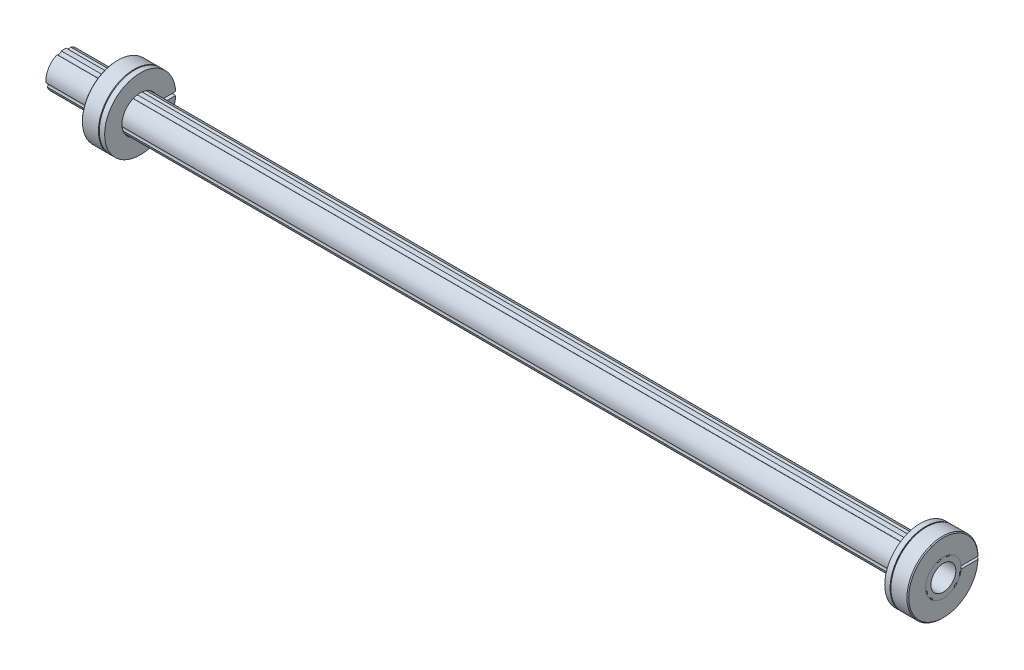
ISO-10303-21;
HEADER;
FILE_DESCRIPTION(('STEP AP214'),'2;1');
FILE_NAME('part.step','',(''),(''),'','','');
FILE_SCHEMA(('AUTOMOTIVE_DESIGN { 1 0 10303 214 1 1 1 1 }'));
ENDSEC;
DATA;
#1=APPLICATION_CONTEXT('core data for automotive mechanical design processes');
#2=APPLICATION_PROTOCOL_DEFINITION('international standard','automotive_design',2000,#1);
#3=PRODUCT_CONTEXT('',#1,'mechanical');
#4=PRODUCT('Part','Part','',(#3));
#5=PRODUCT_RELATED_PRODUCT_CATEGORY('part','',(#4));
#6=PRODUCT_DEFINITION_FORMATION('','',#4);
#7=PRODUCT_DEFINITION_CONTEXT('part definition',#1,'design');
#8=PRODUCT_DEFINITION('design','',#6,#7);
#9=PRODUCT_DEFINITION_SHAPE('','',#8);
#10=(LENGTH_UNIT() NAMED_UNIT(*) SI_UNIT(.MILLI.,.METRE.));
#11=(NAMED_UNIT(*) PLANE_ANGLE_UNIT() SI_UNIT($,.RADIAN.));
#12=(NAMED_UNIT(*) SI_UNIT($,.STERADIAN.) SOLID_ANGLE_UNIT());
#13=UNCERTAINTY_MEASURE_WITH_UNIT(LENGTH_MEASURE(1.E-05),#10,'distance_accuracy_value','');
#14=(GEOMETRIC_REPRESENTATION_CONTEXT(3) GLOBAL_UNCERTAINTY_ASSIGNED_CONTEXT((#13)) GLOBAL_UNIT_ASSIGNED_CONTEXT((#10,
#11,#12)) REPRESENTATION_CONTEXT('',''));
#15=CARTESIAN_POINT('',(0.,0.,0.));
#16=DIRECTION('',(0.,0.,1.));
#17=DIRECTION('',(1.,0.,0.));
#18=AXIS2_PLACEMENT_3D('',#15,#16,#17);
#19=CARTESIAN_POINT('',(409.5,0.,0.));
#20=DIRECTION('',(-1.,0.,0.));
#21=DIRECTION('',(0.,0.,1.));
#22=AXIS2_PLACEMENT_3D('',#19,#20,#21);
#23=CONICAL_SURFACE('',#22,20.,0.785398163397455);
#24=CARTESIAN_POINT('',(410.,0.750000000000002,-19.4855715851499));
#25=CARTESIAN_POINT('',(409.916667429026,0.750000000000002,-19.5689658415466));
#26=CARTESIAN_POINT('',(409.833334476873,0.750000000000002,-19.6523597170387));
#27=CARTESIAN_POINT('',(409.666667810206,0.750000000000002,-19.8191467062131));
#28=CARTESIAN_POINT('',(409.583334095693,0.750000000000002,-19.9025398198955));
#29=CARTESIAN_POINT('',(409.5,0.750000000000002,-19.9859325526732));
#30=B_SPLINE_CURVE_WITH_KNOTS('',3,(#24,#25,#26,#27,#28,#29),.UNSPECIFIED.,.F.,.F.,(4,2,4),(0.,
0.353681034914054,0.707362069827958),.UNSPECIFIED.);
#31=CARTESIAN_POINT('',(410.,0.750000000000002,-19.4855715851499));
#32=VERTEX_POINT('',#31);
#33=CARTESIAN_POINT('',(409.5,0.750000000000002,-19.9859325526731));
#34=VERTEX_POINT('',#33);
#35=EDGE_CURVE('P0_E88',#32,#34,#30,.T.);
#36=ORIENTED_EDGE('',*,*,#35,.T.);
#37=CARTESIAN_POINT('',(409.5,0.,0.));
#38=DIRECTION('',(1.,0.,0.));
#39=DIRECTION('',(0.,0.,-1.));
#40=AXIS2_PLACEMENT_3D('',#37,#38,#39);
#41=CIRCLE('',#40,20.);
#42=CARTESIAN_POINT('',(409.5,-0.749999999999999,-19.9859325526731));
#43=VERTEX_POINT('',#42);
#44=EDGE_CURVE('P0_E71',#43,#34,#41,.F.);
#45=ORIENTED_EDGE('',*,*,#44,.F.);
#46=CARTESIAN_POINT('',(409.5,-0.749999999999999,-19.9859325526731));
#47=CARTESIAN_POINT('',(409.583334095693,-0.749999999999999,-19.9025398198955));
#48=CARTESIAN_POINT('',(409.666667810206,-0.749999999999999,-19.8191467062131));
#49=CARTESIAN_POINT('',(409.833334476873,-0.749999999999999,-19.6523597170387));
#50=CARTESIAN_POINT('',(409.916667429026,-0.749999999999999,-19.5689658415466));
#51=CARTESIAN_POINT('',(410.,-0.749999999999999,-19.4855715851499));
#52=B_SPLINE_CURVE_WITH_KNOTS('',3,(#46,#47,#48,#49,#50,#51),.UNSPECIFIED.,.F.,.F.,(4,2,4),(0.,
0.353681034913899,0.70736206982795),.UNSPECIFIED.);
#53=CARTESIAN_POINT('',(410.,-0.749999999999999,-19.4855715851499));
#54=VERTEX_POINT('',#53);
#55=EDGE_CURVE('P0_E20',#43,#54,#52,.T.);
#56=ORIENTED_EDGE('',*,*,#55,.T.);
#57=CARTESIAN_POINT('',(410.,0.,0.));
#58=DIRECTION('',(-1.,0.,0.));
#59=DIRECTION('',(0.,0.,1.));
#60=AXIS2_PLACEMENT_3D('',#57,#58,#59);
#61=CIRCLE('',#60,19.5);
#62=EDGE_CURVE('P0_E77',#54,#32,#61,.T.);
#63=ORIENTED_EDGE('',*,*,#62,.T.);
#64=EDGE_LOOP('',(#36,#45,#56,#63));
#65=FACE_BOUND('',#64,.T.);
#66=ADVANCED_FACE('P0_F16',(#65),#23,.T.);
#67=CARTESIAN_POINT('',(400.,0.,0.));
#68=DIRECTION('',(1.,0.,0.));
#69=DIRECTION('',(0.,0.,-1.));
#70=AXIS2_PLACEMENT_3D('',#67,#68,#69);
#71=CYLINDRICAL_SURFACE('',#70,20.);
#72=ORIENTED_EDGE('',*,*,#44,.T.);
#73=DIRECTION('',(1.,0.,0.));
#74=VECTOR('',#73,1.);
#75=CARTESIAN_POINT('',(400.,0.750000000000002,-19.9859325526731));
#76=LINE('',#75,#74);
#77=CARTESIAN_POINT('',(400.5,0.750000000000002,-19.9859325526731));
#78=VERTEX_POINT('',#77);
#79=EDGE_CURVE('P0_E104',#34,#78,#76,.F.);
#80=ORIENTED_EDGE('',*,*,#79,.T.);
#81=CARTESIAN_POINT('',(400.5,0.,0.));
#82=DIRECTION('',(1.,0.,0.));
#83=DIRECTION('',(0.,-1.,0.));
#84=AXIS2_PLACEMENT_3D('',#81,#82,#83);
#85=CIRCLE('',#84,20.);
#86=CARTESIAN_POINT('',(400.5,-0.749999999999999,-19.9859325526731));
#87=VERTEX_POINT('',#86);
#88=EDGE_CURVE('P0_E97',#87,#78,#85,.F.);
#89=ORIENTED_EDGE('',*,*,#88,.F.);
#90=DIRECTION('',(1.,0.,0.));
#91=VECTOR('',#90,1.);
#92=CARTESIAN_POINT('',(400.,-0.749999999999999,-19.9859325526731));
#93=LINE('',#92,#91);
#94=EDGE_CURVE('P0_E83',#87,#43,#93,.T.);
#95=ORIENTED_EDGE('',*,*,#94,.T.);
#96=EDGE_LOOP('',(#72,#80,#89,#95));
#97=FACE_BOUND('',#96,.T.);
#98=ADVANCED_FACE('P0_F141',(#97),#71,.T.);
#99=CARTESIAN_POINT('',(410.,0.,0.));
#100=DIRECTION('',(-1.,0.,0.));
#101=DIRECTION('',(0.,0.,1.));
#102=AXIS2_PLACEMENT_3D('',#99,#100,#101);
#103=PLANE('',#102);
#104=ORIENTED_EDGE('',*,*,#62,.F.);
#105=DIRECTION('',(0.,0.,-1.));
#106=VECTOR('',#105,1.);
#107=CARTESIAN_POINT('',(410.,-0.75,-9.97183533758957));
#108=LINE('',#107,#106);
#109=CARTESIAN_POINT('',(410.,-0.75,-9.97183533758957));
#110=VERTEX_POINT('',#109);
#111=EDGE_CURVE('P0_E80',#54,#110,#108,.F.);
#112=ORIENTED_EDGE('',*,*,#111,.T.);
#113=CARTESIAN_POINT('',(410.,0.,0.));
#114=DIRECTION('',(1.,0.,0.));
#115=DIRECTION('',(0.,0.,-1.));
#116=AXIS2_PLACEMENT_3D('',#113,#114,#115);
#117=CIRCLE('',#116,10.);
#118=CARTESIAN_POINT('',(410.,0.750000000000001,-9.97183533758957));
#119=VERTEX_POINT('',#118);
#120=EDGE_CURVE('P0_E117',#110,#119,#117,.F.);
#121=ORIENTED_EDGE('',*,*,#120,.T.);
#122=DIRECTION('',(0.,0.,1.));
#123=VECTOR('',#122,1.);
#124=CARTESIAN_POINT('',(410.,0.750000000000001,-9.97183533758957));
#125=LINE('',#124,#123);
#126=EDGE_CURVE('P0_E82',#119,#32,#125,.F.);
#127=ORIENTED_EDGE('',*,*,#126,.T.);
#128=EDGE_LOOP('',(#104,#112,#121,#127));
#129=FACE_BOUND('',#128,.T.);
#130=ADVANCED_FACE('P0_F78',(#129),#103,.F.);
#131=CARTESIAN_POINT('',(400.,-0.75,-9.97183533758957));
#132=DIRECTION('',(0.,-1.,0.));
#133=DIRECTION('',(0.,0.,-1.));
#134=AXIS2_PLACEMENT_3D('',#131,#132,#133);
#135=PLANE('',#134);
#136=ORIENTED_EDGE('',*,*,#55,.F.);
#137=ORIENTED_EDGE('',*,*,#94,.F.);
#138=CARTESIAN_POINT('',(400.,-0.749999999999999,-19.4855715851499));
#139=CARTESIAN_POINT('',(400.083332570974,-0.749999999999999,-19.5689658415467));
#140=CARTESIAN_POINT('',(400.166665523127,-0.749999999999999,-19.6523597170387));
#141=CARTESIAN_POINT('',(400.333332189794,-0.749999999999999,-19.8191467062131));
#142=CARTESIAN_POINT('',(400.416665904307,-0.749999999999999,-19.9025398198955));
#143=CARTESIAN_POINT('',(400.5,-0.749999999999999,-19.9859325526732));
#144=B_SPLINE_CURVE_WITH_KNOTS('',3,(#138,#139,#140,#141,#142,#143),.UNSPECIFIED.,.F.,.F.,(4,2,
4),(0.,0.353681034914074,0.707362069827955),.UNSPECIFIED.);
#145=CARTESIAN_POINT('',(400.,-0.749999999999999,-19.4855715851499));
#146=VERTEX_POINT('',#145);
#147=EDGE_CURVE('P0_E94',#146,#87,#144,.T.);
#148=ORIENTED_EDGE('',*,*,#147,.F.);
#149=DIRECTION('',(0.,0.,1.));
#150=VECTOR('',#149,1.);
#151=CARTESIAN_POINT('',(400.,-0.75,0.));
#152=LINE('',#151,#150);
#153=CARTESIAN_POINT('',(400.,-0.75,-9.97183533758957));
#154=VERTEX_POINT('',#153);
#155=EDGE_CURVE('P0_E116',#154,#146,#152,.F.);
#156=ORIENTED_EDGE('',*,*,#155,.F.);
#157=DIRECTION('',(1.,0.,0.));
#158=VECTOR('',#157,1.);
#159=CARTESIAN_POINT('',(400.,-0.750000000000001,-9.97183533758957));
#160=LINE('',#159,#158);
#161=EDGE_CURVE('P0_E92',#154,#110,#160,.T.);
#162=ORIENTED_EDGE('',*,*,#161,.T.);
#163=ORIENTED_EDGE('',*,*,#111,.F.);
#164=EDGE_LOOP('',(#136,#137,#148,#156,#162,#163));
#165=FACE_BOUND('',#164,.T.);
#166=ADVANCED_FACE('P0_F89',(#165),#135,.F.);
#167=CARTESIAN_POINT('',(400.5,0.,0.));
#168=DIRECTION('',(1.,0.,0.));
#169=DIRECTION('',(0.,0.,-1.));
#170=AXIS2_PLACEMENT_3D('',#167,#168,#169);
#171=CONICAL_SURFACE('',#170,20.,0.785398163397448);
#172=ORIENTED_EDGE('',*,*,#88,.T.);
#173=CARTESIAN_POINT('',(400.5,0.750000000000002,-19.9859325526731));
#174=CARTESIAN_POINT('',(400.416665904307,0.750000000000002,-19.9025398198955));
#175=CARTESIAN_POINT('',(400.333332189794,0.750000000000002,-19.8191467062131));
#176=CARTESIAN_POINT('',(400.166665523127,0.750000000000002,-19.6523597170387));
#177=CARTESIAN_POINT('',(400.083332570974,0.750000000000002,-19.5689658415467));
#178=CARTESIAN_POINT('',(400.,0.750000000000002,-19.4855715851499));
#179=B_SPLINE_CURVE_WITH_KNOTS('',3,(#173,#174,#175,#176,#177,#178),.UNSPECIFIED.,.F.,.F.,(4,2,
4),(0.,0.353681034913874,0.707362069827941),.UNSPECIFIED.);
#180=CARTESIAN_POINT('',(400.,0.750000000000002,-19.4855715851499));
#181=VERTEX_POINT('',#180);
#182=EDGE_CURVE('P0_E105',#78,#181,#179,.T.);
#183=ORIENTED_EDGE('',*,*,#182,.T.);
#184=CARTESIAN_POINT('',(400.,0.,0.));
#185=DIRECTION('',(1.,0.,0.));
#186=DIRECTION('',(0.,0.,-1.));
#187=AXIS2_PLACEMENT_3D('',#184,#185,#186);
#188=CIRCLE('',#187,19.5);
#189=EDGE_CURVE('P0_E114',#146,#181,#188,.F.);
#190=ORIENTED_EDGE('',*,*,#189,.F.);
#191=ORIENTED_EDGE('',*,*,#147,.T.);
#192=EDGE_LOOP('',(#172,#183,#190,#191));
#193=FACE_BOUND('',#192,.T.);
#194=ADVANCED_FACE('P0_F131',(#193),#171,.T.);
#195=CARTESIAN_POINT('',(400.,0.750000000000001,-9.97183533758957));
#196=DIRECTION('',(0.,1.,0.));
#197=DIRECTION('',(0.,0.,1.));
#198=AXIS2_PLACEMENT_3D('',#195,#196,#197);
#199=PLANE('',#198);
#200=ORIENTED_EDGE('',*,*,#35,.F.);
#201=ORIENTED_EDGE('',*,*,#126,.F.);
#202=DIRECTION('',(1.,0.,0.));
#203=VECTOR('',#202,1.);
#204=CARTESIAN_POINT('',(400.,0.750000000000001,-9.97183533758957));
#205=LINE('',#204,#203);
#206=CARTESIAN_POINT('',(400.,0.750000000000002,-9.97183533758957));
#207=VERTEX_POINT('',#206);
#208=EDGE_CURVE('P0_E39',#119,#207,#205,.F.);
#209=ORIENTED_EDGE('',*,*,#208,.T.);
#210=DIRECTION('',(0.,0.,1.));
#211=VECTOR('',#210,1.);
#212=CARTESIAN_POINT('',(400.,0.750000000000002,0.));
#213=LINE('',#212,#211);
#214=EDGE_CURVE('P0_E30',#181,#207,#213,.T.);
#215=ORIENTED_EDGE('',*,*,#214,.F.);
#216=ORIENTED_EDGE('',*,*,#182,.F.);
#217=ORIENTED_EDGE('',*,*,#79,.F.);
#218=EDGE_LOOP('',(#200,#201,#209,#215,#216,#217));
#219=FACE_BOUND('',#218,.T.);
#220=ADVANCED_FACE('P0_F128',(#219),#199,.F.);
#221=CARTESIAN_POINT('',(400.,0.,0.));
#222=DIRECTION('',(1.,0.,0.));
#223=DIRECTION('',(0.,0.,-1.));
#224=AXIS2_PLACEMENT_3D('',#221,#222,#223);
#225=CYLINDRICAL_SURFACE('',#224,10.);
#226=ORIENTED_EDGE('',*,*,#161,.F.);
#227=CARTESIAN_POINT('',(400.,0.,0.));
#228=DIRECTION('',(1.,0.,0.));
#229=DIRECTION('',(0.,0.,-1.));
#230=AXIS2_PLACEMENT_3D('',#227,#228,#229);
#231=CIRCLE('',#230,10.);
#232=EDGE_CURVE('P0_E11',#207,#154,#231,.T.);
#233=ORIENTED_EDGE('',*,*,#232,.F.);
#234=ORIENTED_EDGE('',*,*,#208,.F.);
#235=ORIENTED_EDGE('',*,*,#120,.F.);
#236=EDGE_LOOP('',(#226,#233,#234,#235));
#237=FACE_BOUND('',#236,.T.);
#238=ADVANCED_FACE('P0_F150',(#237),#225,.F.);
#239=CARTESIAN_POINT('',(400.,0.,0.));
#240=DIRECTION('',(-1.,0.,0.));
#241=DIRECTION('',(0.,0.,1.));
#242=AXIS2_PLACEMENT_3D('',#239,#240,#241);
#243=PLANE('',#242);
#244=ORIENTED_EDGE('',*,*,#232,.T.);
#245=ORIENTED_EDGE('',*,*,#155,.T.);
#246=ORIENTED_EDGE('',*,*,#189,.T.);
#247=ORIENTED_EDGE('',*,*,#214,.T.);
#248=EDGE_LOOP('',(#244,#245,#246,#247));
#249=FACE_BOUND('',#248,.T.);
#250=ADVANCED_FACE('P0_F148',(#249),#243,.T.);
#251=CLOSED_SHELL('',(#66,#98,#130,#166,#194,#220,#238,#250));
#252=MANIFOLD_SOLID_BREP('P0_B1',#251);
#253=CARTESIAN_POINT('',(115.,5.2642957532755,1.41056379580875));
#254=DIRECTION('',(1.,0.,0.));
#255=DIRECTION('',(0.,0.,-1.));
#256=AXIS2_PLACEMENT_3D('',#253,#254,#255);
#257=PLANE('',#256);
#258=CARTESIAN_POINT('',(115.,0.,0.));
#259=DIRECTION('',(-1.,0.,0.));
#260=DIRECTION('',(0.,0.,1.));
#261=AXIS2_PLACEMENT_3D('',#258,#259,#260);
#262=CIRCLE('',#261,7.);
#263=CARTESIAN_POINT('',(115.,0.,7.));
#264=VERTEX_POINT('',#263);
#265=EDGE_CURVE('P1_E175',#264,#264,#262,.T.);
#266=ORIENTED_EDGE('',*,*,#265,.T.);
#267=EDGE_LOOP('',(#266));
#268=FACE_BOUND('',#267,.T.);
#269=ADVANCED_FACE('P1_F16',(#268),#257,.F.);
#270=CARTESIAN_POINT('',(200.,0.,0.));
#271=DIRECTION('',(-1.,0.,0.));
#272=DIRECTION('',(0.,0.,1.));
#273=AXIS2_PLACEMENT_3D('',#270,#271,#272);
#274=PLANE('',#273);
#275=CARTESIAN_POINT('',(200.,0.,0.));
#276=DIRECTION('',(-1.,0.,0.));
#277=DIRECTION('',(0.,0.,1.));
#278=AXIS2_PLACEMENT_3D('',#275,#276,#277);
#279=CIRCLE('',#278,7.);
#280=CARTESIAN_POINT('',(200.,0.,7.));
#281=VERTEX_POINT('',#280);
#282=EDGE_CURVE('P1_E156',#281,#281,#279,.F.);
#283=ORIENTED_EDGE('',*,*,#282,.T.);
#284=EDGE_LOOP('',(#283));
#285=FACE_BOUND('',#284,.T.);
#286=ADVANCED_FACE('P1_F409',(#285),#274,.F.);
#287=CARTESIAN_POINT('',(-65.,-25.7324547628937,-10.000025));
#288=DIRECTION('',(1.,0.,0.));
#289=DIRECTION('',(0.,1.,0.));
#290=AXIS2_PLACEMENT_3D('',#287,#288,#289);
#291=PLANE('',#290);
#292=CARTESIAN_POINT('',(-65.,0.,0.));
#293=DIRECTION('',(-1.,0.,0.));
#294=DIRECTION('',(0.,0.,1.));
#295=AXIS2_PLACEMENT_3D('',#292,#293,#294);
#296=CIRCLE('',#295,10.);
#297=CARTESIAN_POINT('',(-65.,-1.35978777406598,-9.90711750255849));
#298=VERTEX_POINT('',#297);
#299=CARTESIAN_POINT('',(-65.,4.35889894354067,-9.));
#300=VERTEX_POINT('',#299);
#301=EDGE_CURVE('P1_E131',#298,#300,#296,.F.);
#302=ORIENTED_EDGE('',*,*,#301,.F.);
#303=CARTESIAN_POINT('',(-65.,-2.8211275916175,-10.528591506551));
#304=DIRECTION('',(1.,0.,0.));
#305=DIRECTION('',(0.,0.,-1.));
#306=AXIS2_PLACEMENT_3D('',#303,#304,#305);
#307=CIRCLE('',#306,1.588);
#308=CARTESIAN_POINT('',(-65.,-2.39083466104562,-9.));
#309=VERTEX_POINT('',#308);
#310=EDGE_CURVE('P1_E19',#309,#298,#307,.F.);
#311=ORIENTED_EDGE('',*,*,#310,.F.);
#312=DIRECTION('',(0.,1.,0.));
#313=VECTOR('',#312,1.);
#314=CARTESIAN_POINT('',(-65.,25.7324547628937,-9.));
#315=LINE('',#314,#313);
#316=EDGE_CURVE('P1_E133',#309,#300,#315,.T.);
#317=ORIENTED_EDGE('',*,*,#316,.T.);
#318=EDGE_LOOP('',(#302,#311,#317));
#319=FACE_BOUND('',#318,.T.);
#320=ADVANCED_FACE('P1_F132',(#319),#291,.F.);
#321=CARTESIAN_POINT('',(-75.,-25.7324547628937,-10.000025));
#322=DIRECTION('',(-1.,0.,0.));
#323=DIRECTION('',(0.,-1.,0.));
#324=AXIS2_PLACEMENT_3D('',#321,#322,#323);
#325=PLANE('',#324);
#326=DIRECTION('',(0.,1.,0.));
#327=VECTOR('',#326,1.);
#328=CARTESIAN_POINT('',(-75.0000000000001,25.7324547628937,-9.));
#329=LINE('',#328,#327);
#330=CARTESIAN_POINT('',(-75.0000000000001,4.35889894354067,-9.));
#331=VERTEX_POINT('',#330);
#332=CARTESIAN_POINT('',(-75.,-2.39083466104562,-9.));
#333=VERTEX_POINT('',#332);
#334=EDGE_CURVE('P1_E182',#331,#333,#329,.F.);
#335=ORIENTED_EDGE('',*,*,#334,.T.);
#336=CARTESIAN_POINT('',(-75.,-2.8211275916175,-10.528591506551));
#337=DIRECTION('',(1.,0.,0.));
#338=DIRECTION('',(0.,0.,-1.));
#339=AXIS2_PLACEMENT_3D('',#336,#337,#338);
#340=CIRCLE('',#339,1.588);
#341=CARTESIAN_POINT('',(-75.,-1.35978777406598,-9.90711750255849));
#342=VERTEX_POINT('',#341);
#343=EDGE_CURVE('P1_E129',#342,#333,#340,.T.);
#344=ORIENTED_EDGE('',*,*,#343,.F.);
#345=CARTESIAN_POINT('',(-75.0000000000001,0.,0.));
#346=DIRECTION('',(-1.,0.,0.));
#347=DIRECTION('',(0.,0.,1.));
#348=AXIS2_PLACEMENT_3D('',#345,#346,#347);
#349=CIRCLE('',#348,10.);
#350=EDGE_CURVE('P1_E149',#331,#342,#349,.T.);
#351=ORIENTED_EDGE('',*,*,#350,.F.);
#352=EDGE_LOOP('',(#335,#344,#351));
#353=FACE_BOUND('',#352,.T.);
#354=ADVANCED_FACE('P1_F267',(#353),#325,.F.);
#355=CARTESIAN_POINT('',(-75.,25.7324547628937,-9.));
#356=DIRECTION('',(0.,0.,1.));
#357=DIRECTION('',(1.,0.,0.));
#358=AXIS2_PLACEMENT_3D('',#355,#356,#357);
#359=PLANE('',#358);
#360=DIRECTION('',(-1.,0.,0.));
#361=VECTOR('',#360,1.);
#362=CARTESIAN_POINT('',(410.,4.35889894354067,-9.));
#363=LINE('',#362,#361);
#364=EDGE_CURVE('P1_E137',#300,#331,#363,.T.);
#365=ORIENTED_EDGE('',*,*,#364,.F.);
#366=ORIENTED_EDGE('',*,*,#316,.F.);
#367=DIRECTION('',(1.,0.,0.));
#368=VECTOR('',#367,1.);
#369=CARTESIAN_POINT('',(410.,-2.39083466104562,-9.));
#370=LINE('',#369,#368);
#371=EDGE_CURVE('P1_E128',#309,#333,#370,.F.);
#372=ORIENTED_EDGE('',*,*,#371,.T.);
#373=ORIENTED_EDGE('',*,*,#334,.F.);
#374=EDGE_LOOP('',(#365,#366,#372,#373));
#375=FACE_BOUND('',#374,.T.);
#376=ADVANCED_FACE('P1_F269',(#375),#359,.F.);
#377=CARTESIAN_POINT('',(-75.,-25.7324547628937,-10.000025));
#378=DIRECTION('',(-1.,0.,0.));
#379=DIRECTION('',(0.,-1.,0.));
#380=AXIS2_PLACEMENT_3D('',#377,#378,#379);
#381=PLANE('',#380);
#382=CARTESIAN_POINT('',(-75.,0.,0.));
#383=DIRECTION('',(-1.,0.,0.));
#384=DIRECTION('',(0.,0.,1.));
#385=AXIS2_PLACEMENT_3D('',#382,#383,#384);
#386=CIRCLE('',#385,10.);
#387=CARTESIAN_POINT('',(-75.,-3.77594799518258,-9.2597093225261));
#388=VERTEX_POINT('',#387);
#389=CARTESIAN_POINT('',(-75.,-4.35889894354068,-9.));
#390=VERTEX_POINT('',#389);
#391=EDGE_CURVE('P1_E171',#388,#390,#386,.T.);
#392=ORIENTED_EDGE('',*,*,#391,.F.);
#393=CARTESIAN_POINT('',(-75.,-2.8211275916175,-10.528591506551));
#394=DIRECTION('',(1.,0.,0.));
#395=DIRECTION('',(0.,0.,-1.));
#396=AXIS2_PLACEMENT_3D('',#393,#394,#395);
#397=CIRCLE('',#396,1.588);
#398=CARTESIAN_POINT('',(-75.,-3.25142052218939,-9.));
#399=VERTEX_POINT('',#398);
#400=EDGE_CURVE('P1_E167',#388,#399,#397,.F.);
#401=ORIENTED_EDGE('',*,*,#400,.T.);
#402=DIRECTION('',(0.,1.,0.));
#403=VECTOR('',#402,1.);
#404=CARTESIAN_POINT('',(-75.,25.7324547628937,-9.));
#405=LINE('',#404,#403);
#406=EDGE_CURVE('P1_E176',#399,#390,#405,.F.);
#407=ORIENTED_EDGE('',*,*,#406,.T.);
#408=EDGE_LOOP('',(#392,#401,#407));
#409=FACE_BOUND('',#408,.T.);
#410=ADVANCED_FACE('P1_F349',(#409),#381,.F.);
#411=CARTESIAN_POINT('',(-75.,25.7324547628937,-9.));
#412=DIRECTION('',(0.,0.,1.));
#413=DIRECTION('',(1.,0.,0.));
#414=AXIS2_PLACEMENT_3D('',#411,#412,#413);
#415=PLANE('',#414);
#416=DIRECTION('',(-1.,0.,0.));
#417=VECTOR('',#416,1.);
#418=CARTESIAN_POINT('',(410.,-4.35889894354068,-9.));
#419=LINE('',#418,#417);
#420=CARTESIAN_POINT('',(-65.,-4.35889894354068,-9.));
#421=VERTEX_POINT('',#420);
#422=EDGE_CURVE('P1_E177',#390,#421,#419,.F.);
#423=ORIENTED_EDGE('',*,*,#422,.F.);
#424=ORIENTED_EDGE('',*,*,#406,.F.);
#425=DIRECTION('',(1.,0.,0.));
#426=VECTOR('',#425,1.);
#427=CARTESIAN_POINT('',(410.,-3.25142052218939,-9.));
#428=LINE('',#427,#426);
#429=CARTESIAN_POINT('',(-65.,-3.25142052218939,-9.));
#430=VERTEX_POINT('',#429);
#431=EDGE_CURVE('P1_E183',#399,#430,#428,.T.);
#432=ORIENTED_EDGE('',*,*,#431,.T.);
#433=DIRECTION('',(0.,1.,0.));
#434=VECTOR('',#433,1.);
#435=CARTESIAN_POINT('',(-65.,-25.7324547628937,-9.));
#436=LINE('',#435,#434);
#437=EDGE_CURVE('P1_E173',#430,#421,#436,.F.);
#438=ORIENTED_EDGE('',*,*,#437,.T.);
#439=EDGE_LOOP('',(#423,#424,#432,#438));
#440=FACE_BOUND('',#439,.T.);
#441=ADVANCED_FACE('P1_F353',(#440),#415,.F.);
#442=CARTESIAN_POINT('',(-65.,-25.7324547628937,-10.000025));
#443=DIRECTION('',(1.,0.,0.));
#444=DIRECTION('',(0.,1.,0.));
#445=AXIS2_PLACEMENT_3D('',#442,#443,#444);
#446=PLANE('',#445);
#447=ORIENTED_EDGE('',*,*,#437,.F.);
#448=CARTESIAN_POINT('',(-65.,-2.8211275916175,-10.528591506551));
#449=DIRECTION('',(1.,0.,0.));
#450=DIRECTION('',(0.,0.,-1.));
#451=AXIS2_PLACEMENT_3D('',#448,#449,#450);
#452=CIRCLE('',#451,1.588);
#453=CARTESIAN_POINT('',(-65.,-3.77594799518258,-9.2597093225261));
#454=VERTEX_POINT('',#453);
#455=EDGE_CURVE('P1_E172',#430,#454,#452,.T.);
#456=ORIENTED_EDGE('',*,*,#455,.T.);
#457=CARTESIAN_POINT('',(-65.,0.,0.));
#458=DIRECTION('',(-1.,0.,0.));
#459=DIRECTION('',(0.,0.,1.));
#460=AXIS2_PLACEMENT_3D('',#457,#458,#459);
#461=CIRCLE('',#460,10.);
#462=EDGE_CURVE('P1_E180',#421,#454,#461,.F.);
#463=ORIENTED_EDGE('',*,*,#462,.F.);
#464=EDGE_LOOP('',(#447,#456,#463));
#465=FACE_BOUND('',#464,.T.);
#466=ADVANCED_FACE('P1_F356',(#465),#446,.F.);
#467=CARTESIAN_POINT('',(325.,0.,0.));
#468=DIRECTION('',(-1.,0.,0.));
#469=DIRECTION('',(0.,0.,1.));
#470=AXIS2_PLACEMENT_3D('',#467,#468,#469);
#471=CYLINDRICAL_SURFACE('',#470,7.);
#472=ORIENTED_EDGE('',*,*,#265,.F.);
#473=EDGE_LOOP('',(#472));
#474=FACE_BOUND('',#473,.T.);
#475=CARTESIAN_POINT('',(-85.,0.,0.));
#476=DIRECTION('',(-1.,0.,0.));
#477=DIRECTION('',(0.,0.,1.));
#478=AXIS2_PLACEMENT_3D('',#475,#476,#477);
#479=CIRCLE('',#478,7.);
#480=CARTESIAN_POINT('',(-85.,0.,7.));
#481=VERTEX_POINT('',#480);
#482=EDGE_CURVE('P1_E160',#481,#481,#479,.T.);
#483=ORIENTED_EDGE('',*,*,#482,.T.);
#484=EDGE_LOOP('',(#483));
#485=FACE_BOUND('',#484,.T.);
#486=ADVANCED_FACE('P1_F358',(#474,#485),#471,.F.);
#487=CARTESIAN_POINT('',(410.,0.,0.));
#488=DIRECTION('',(-1.,0.,0.));
#489=DIRECTION('',(0.,0.,1.));
#490=AXIS2_PLACEMENT_3D('',#487,#488,#489);
#491=CYLINDRICAL_SURFACE('',#490,7.);
#492=CARTESIAN_POINT('',(410.,0.,0.));
#493=DIRECTION('',(-1.,0.,0.));
#494=DIRECTION('',(0.,0.,1.));
#495=AXIS2_PLACEMENT_3D('',#492,#493,#494);
#496=CIRCLE('',#495,7.);
#497=CARTESIAN_POINT('',(410.,0.,7.));
#498=VERTEX_POINT('',#497);
#499=EDGE_CURVE('P1_E220',#498,#498,#496,.F.);
#500=ORIENTED_EDGE('',*,*,#499,.T.);
#501=EDGE_LOOP('',(#500));
#502=FACE_BOUND('',#501,.T.);
#503=ORIENTED_EDGE('',*,*,#282,.F.);
#504=EDGE_LOOP('',(#503));
#505=FACE_BOUND('',#504,.T.);
#506=ADVANCED_FACE('P1_F365',(#502,#505),#491,.F.);
#507=CARTESIAN_POINT('',(410.,0.,0.));
#508=DIRECTION('',(-1.,0.,0.));
#509=DIRECTION('',(0.,0.,1.));
#510=AXIS2_PLACEMENT_3D('',#507,#508,#509);
#511=CYLINDRICAL_SURFACE('',#510,10.);
#512=DIRECTION('',(1.,0.,0.));
#513=VECTOR('',#512,1.);
#514=CARTESIAN_POINT('',(410.,-6.13116950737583,7.89992154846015));
#515=LINE('',#514,#513);
#516=CARTESIAN_POINT('',(-85.,-6.13116950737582,7.89992154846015));
#517=VERTEX_POINT('',#516);
#518=CARTESIAN_POINT('',(410.,-6.13116950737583,7.89992154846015));
#519=VERTEX_POINT('',#518);
#520=EDGE_CURVE('P1_E161',#517,#519,#515,.T.);
#521=ORIENTED_EDGE('',*,*,#520,.T.);
#522=CARTESIAN_POINT('',(410.,0.,0.));
#523=DIRECTION('',(-1.,0.,0.));
#524=DIRECTION('',(0.,0.,1.));
#525=AXIS2_PLACEMENT_3D('',#522,#523,#524);
#526=CIRCLE('',#525,10.);
#527=CARTESIAN_POINT('',(410.,-3.77594799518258,9.25970932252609));
#528=VERTEX_POINT('',#527);
#529=EDGE_CURVE('P1_E218',#519,#528,#526,.T.);
#530=ORIENTED_EDGE('',*,*,#529,.T.);
#531=DIRECTION('',(1.,0.,0.));
#532=VECTOR('',#531,1.);
#533=CARTESIAN_POINT('',(410.,-3.77594799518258,9.25970932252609));
#534=LINE('',#533,#532);
#535=CARTESIAN_POINT('',(-85.,-3.77594799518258,9.25970932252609));
#536=VERTEX_POINT('',#535);
#537=EDGE_CURVE('P1_E162',#528,#536,#534,.F.);
#538=ORIENTED_EDGE('',*,*,#537,.T.);
#539=CARTESIAN_POINT('',(-85.,0.,0.));
#540=DIRECTION('',(-1.,0.,0.));
#541=DIRECTION('',(0.,0.,1.));
#542=AXIS2_PLACEMENT_3D('',#539,#540,#541);
#543=CIRCLE('',#542,10.);
#544=EDGE_CURVE('P1_E247',#536,#517,#543,.F.);
#545=ORIENTED_EDGE('',*,*,#544,.T.);
#546=EDGE_LOOP('',(#521,#530,#538,#545));
#547=FACE_BOUND('',#546,.T.);
#548=ADVANCED_FACE('P1_F324',(#547),#511,.T.);
#549=CARTESIAN_POINT('',(410.,0.,0.));
#550=DIRECTION('',(-1.,0.,0.));
#551=DIRECTION('',(0.,0.,1.));
#552=AXIS2_PLACEMENT_3D('',#549,#550,#551);
#553=CYLINDRICAL_SURFACE('',#552,10.);
#554=DIRECTION('',(1.,0.,0.));
#555=VECTOR('',#554,1.);
#556=CARTESIAN_POINT('',(410.,9.90711750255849,1.35978777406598));
#557=LINE('',#556,#555);
#558=CARTESIAN_POINT('',(-85.,9.90711750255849,1.35978777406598));
#559=VERTEX_POINT('',#558);
#560=CARTESIAN_POINT('',(410.,9.90711750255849,1.35978777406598));
#561=VERTEX_POINT('',#560);
#562=EDGE_CURVE('P1_E157',#559,#561,#557,.T.);
#563=ORIENTED_EDGE('',*,*,#562,.T.);
#564=CARTESIAN_POINT('',(410.,0.,0.));
#565=DIRECTION('',(-1.,0.,0.));
#566=DIRECTION('',(0.,0.,1.));
#567=AXIS2_PLACEMENT_3D('',#564,#565,#566);
#568=CIRCLE('',#567,10.);
#569=CARTESIAN_POINT('',(410.,9.90711750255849,-1.35978777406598));
#570=VERTEX_POINT('',#569);
#571=EDGE_CURVE('P1_E211',#561,#570,#568,.T.);
#572=ORIENTED_EDGE('',*,*,#571,.T.);
#573=DIRECTION('',(1.,0.,0.));
#574=VECTOR('',#573,1.);
#575=CARTESIAN_POINT('',(410.,9.90711750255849,-1.35978777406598));
#576=LINE('',#575,#574);
#577=CARTESIAN_POINT('',(-85.,9.90711750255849,-1.35978777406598));
#578=VERTEX_POINT('',#577);
#579=EDGE_CURVE('P1_E138',#570,#578,#576,.F.);
#580=ORIENTED_EDGE('',*,*,#579,.T.);
#581=CARTESIAN_POINT('',(-85.,0.,0.));
#582=DIRECTION('',(-1.,0.,0.));
#583=DIRECTION('',(0.,0.,1.));
#584=AXIS2_PLACEMENT_3D('',#581,#582,#583);
#585=CIRCLE('',#584,10.);
#586=EDGE_CURVE('P1_E165',#578,#559,#585,.F.);
#587=ORIENTED_EDGE('',*,*,#586,.T.);
#588=EDGE_LOOP('',(#563,#572,#580,#587));
#589=FACE_BOUND('',#588,.T.);
#590=ADVANCED_FACE('P1_F396',(#589),#553,.T.);
#591=CARTESIAN_POINT('',(410.,10.528591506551,-2.8211275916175));
#592=DIRECTION('',(1.,0.,0.));
#593=DIRECTION('',(0.,0.,-1.));
#594=AXIS2_PLACEMENT_3D('',#591,#592,#593);
#595=CYLINDRICAL_SURFACE('',#594,1.588);
#596=CARTESIAN_POINT('',(-85.,10.528591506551,-2.8211275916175));
#597=DIRECTION('',(1.,0.,0.));
#598=DIRECTION('',(0.,0.,-1.));
#599=AXIS2_PLACEMENT_3D('',#596,#597,#598);
#600=CIRCLE('',#599,1.588);
#601=CARTESIAN_POINT('',(-85.,9.2597093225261,-3.77594799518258));
#602=VERTEX_POINT('',#601);
#603=EDGE_CURVE('P1_E226',#602,#578,#600,.F.);
#604=ORIENTED_EDGE('',*,*,#603,.T.);
#605=ORIENTED_EDGE('',*,*,#579,.F.);
#606=CARTESIAN_POINT('',(410.,10.528591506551,-2.8211275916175));
#607=DIRECTION('',(1.,0.,0.));
#608=DIRECTION('',(0.,0.,-1.));
#609=AXIS2_PLACEMENT_3D('',#606,#607,#608);
#610=CIRCLE('',#609,1.588);
#611=CARTESIAN_POINT('',(410.,9.2597093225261,-3.77594799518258));
#612=VERTEX_POINT('',#611);
#613=EDGE_CURVE('P1_E208',#570,#612,#610,.T.);
#614=ORIENTED_EDGE('',*,*,#613,.T.);
#615=DIRECTION('',(-1.,0.,0.));
#616=VECTOR('',#615,1.);
#617=CARTESIAN_POINT('',(410.,9.2597093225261,-3.77594799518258));
#618=LINE('',#617,#616);
#619=EDGE_CURVE('P1_E145',#602,#612,#618,.F.);
#620=ORIENTED_EDGE('',*,*,#619,.F.);
#621=EDGE_LOOP('',(#604,#605,#614,#620));
#622=FACE_BOUND('',#621,.T.);
#623=ADVANCED_FACE('P1_F281',(#622),#595,.F.);
#624=CARTESIAN_POINT('',(410.,0.,0.));
#625=DIRECTION('',(-1.,0.,0.));
#626=DIRECTION('',(0.,0.,1.));
#627=AXIS2_PLACEMENT_3D('',#624,#625,#626);
#628=CYLINDRICAL_SURFACE('',#627,10.);
#629=ORIENTED_EDGE('',*,*,#619,.T.);
#630=CARTESIAN_POINT('',(410.,0.,0.));
#631=DIRECTION('',(-1.,0.,0.));
#632=DIRECTION('',(0.,0.,1.));
#633=AXIS2_PLACEMENT_3D('',#630,#631,#632);
#634=CIRCLE('',#633,10.);
#635=CARTESIAN_POINT('',(410.,-1.35978777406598,-9.90711750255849));
#636=VERTEX_POINT('',#635);
#637=EDGE_CURVE('P1_E144',#612,#636,#634,.T.);
#638=ORIENTED_EDGE('',*,*,#637,.T.);
#639=DIRECTION('',(1.,0.,0.));
#640=VECTOR('',#639,1.);
#641=CARTESIAN_POINT('',(410.,-1.35978777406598,-9.90711750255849));
#642=LINE('',#641,#640);
#643=EDGE_CURVE('P1_E125',#636,#298,#642,.F.);
#644=ORIENTED_EDGE('',*,*,#643,.T.);
#645=ORIENTED_EDGE('',*,*,#301,.T.);
#646=ORIENTED_EDGE('',*,*,#364,.T.);
#647=ORIENTED_EDGE('',*,*,#350,.T.);
#648=DIRECTION('',(1.,0.,0.));
#649=VECTOR('',#648,1.);
#650=CARTESIAN_POINT('',(410.,-1.35978777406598,-9.90711750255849));
#651=LINE('',#650,#649);
#652=CARTESIAN_POINT('',(-85.,-1.35978777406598,-9.90711750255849));
#653=VERTEX_POINT('',#652);
#654=EDGE_CURVE('P1_E147',#342,#653,#651,.F.);
#655=ORIENTED_EDGE('',*,*,#654,.T.);
#656=CARTESIAN_POINT('',(-85.,0.,0.));
#657=DIRECTION('',(-1.,0.,0.));
#658=DIRECTION('',(0.,0.,1.));
#659=AXIS2_PLACEMENT_3D('',#656,#657,#658);
#660=CIRCLE('',#659,10.);
#661=EDGE_CURVE('P1_E229',#653,#602,#660,.F.);
#662=ORIENTED_EDGE('',*,*,#661,.T.);
#663=EDGE_LOOP('',(#629,#638,#644,#645,#646,#647,#655,#662));
#664=FACE_BOUND('',#663,.T.);
#665=ADVANCED_FACE('P1_F142',(#664),#628,.T.);
#666=CARTESIAN_POINT('',(410.,-2.8211275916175,-10.528591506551));
#667=DIRECTION('',(1.,0.,0.));
#668=DIRECTION('',(0.,0.,-1.));
#669=AXIS2_PLACEMENT_3D('',#666,#667,#668);
#670=CYLINDRICAL_SURFACE('',#669,1.588);
#671=ORIENTED_EDGE('',*,*,#455,.F.);
#672=ORIENTED_EDGE('',*,*,#431,.F.);
#673=ORIENTED_EDGE('',*,*,#400,.F.);
#674=DIRECTION('',(-1.,0.,0.));
#675=VECTOR('',#674,1.);
#676=CARTESIAN_POINT('',(410.,-3.77594799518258,-9.2597093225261));
#677=LINE('',#676,#675);
#678=CARTESIAN_POINT('',(-85.,-3.77594799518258,-9.2597093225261));
#679=VERTEX_POINT('',#678);
#680=EDGE_CURVE('P1_E168',#679,#388,#677,.F.);
#681=ORIENTED_EDGE('',*,*,#680,.F.);
#682=CARTESIAN_POINT('',(-85.,-2.8211275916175,-10.528591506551));
#683=DIRECTION('',(1.,0.,0.));
#684=DIRECTION('',(0.,0.,-1.));
#685=AXIS2_PLACEMENT_3D('',#682,#683,#684);
#686=CIRCLE('',#685,1.588);
#687=EDGE_CURVE('P1_E232',#679,#653,#686,.F.);
#688=ORIENTED_EDGE('',*,*,#687,.T.);
#689=ORIENTED_EDGE('',*,*,#654,.F.);
#690=ORIENTED_EDGE('',*,*,#343,.T.);
#691=ORIENTED_EDGE('',*,*,#371,.F.);
#692=ORIENTED_EDGE('',*,*,#310,.T.);
#693=ORIENTED_EDGE('',*,*,#643,.F.);
#694=CARTESIAN_POINT('',(410.,-2.8211275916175,-10.528591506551));
#695=DIRECTION('',(1.,0.,0.));
#696=DIRECTION('',(0.,0.,-1.));
#697=AXIS2_PLACEMENT_3D('',#694,#695,#696);
#698=CIRCLE('',#697,1.588);
#699=CARTESIAN_POINT('',(410.,-3.77594799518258,-9.2597093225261));
#700=VERTEX_POINT('',#699);
#701=EDGE_CURVE('P1_E205',#636,#700,#698,.T.);
#702=ORIENTED_EDGE('',*,*,#701,.T.);
#703=DIRECTION('',(-1.,0.,0.));
#704=VECTOR('',#703,1.);
#705=CARTESIAN_POINT('',(410.,-3.77594799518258,-9.2597093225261));
#706=LINE('',#705,#704);
#707=EDGE_CURVE('P1_E152',#454,#700,#706,.F.);
#708=ORIENTED_EDGE('',*,*,#707,.F.);
#709=EDGE_LOOP('',(#671,#672,#673,#681,#688,#689,#690,#691,#692,#693,#702,#708));
#710=FACE_BOUND('',#709,.T.);
#711=ADVANCED_FACE('P1_F121',(#710),#670,.F.);
#712=CARTESIAN_POINT('',(410.,0.,0.));
#713=DIRECTION('',(-1.,0.,0.));
#714=DIRECTION('',(0.,0.,1.));
#715=AXIS2_PLACEMENT_3D('',#712,#713,#714);
#716=CYLINDRICAL_SURFACE('',#715,10.);
#717=ORIENTED_EDGE('',*,*,#707,.T.);
#718=CARTESIAN_POINT('',(410.,0.,0.));
#719=DIRECTION('',(-1.,0.,0.));
#720=DIRECTION('',(0.,0.,1.));
#721=AXIS2_PLACEMENT_3D('',#718,#719,#720);
#722=CIRCLE('',#721,10.);
#723=CARTESIAN_POINT('',(410.,-6.13116950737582,-7.89992154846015));
#724=VERTEX_POINT('',#723);
#725=EDGE_CURVE('P1_E202',#700,#724,#722,.T.);
#726=ORIENTED_EDGE('',*,*,#725,.T.);
#727=DIRECTION('',(1.,0.,0.));
#728=VECTOR('',#727,1.);
#729=CARTESIAN_POINT('',(410.,-6.13116950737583,-7.89992154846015));
#730=LINE('',#729,#728);
#731=CARTESIAN_POINT('',(-85.,-6.13116950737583,-7.89992154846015));
#732=VERTEX_POINT('',#731);
#733=EDGE_CURVE('P1_E303',#724,#732,#730,.F.);
#734=ORIENTED_EDGE('',*,*,#733,.T.);
#735=CARTESIAN_POINT('',(-85.,0.,0.));
#736=DIRECTION('',(-1.,0.,0.));
#737=DIRECTION('',(0.,0.,1.));
#738=AXIS2_PLACEMENT_3D('',#735,#736,#737);
#739=CIRCLE('',#738,10.);
#740=EDGE_CURVE('P1_E235',#732,#679,#739,.F.);
#741=ORIENTED_EDGE('',*,*,#740,.T.);
#742=ORIENTED_EDGE('',*,*,#680,.T.);
#743=ORIENTED_EDGE('',*,*,#391,.T.);
#744=ORIENTED_EDGE('',*,*,#422,.T.);
#745=ORIENTED_EDGE('',*,*,#462,.T.);
#746=EDGE_LOOP('',(#717,#726,#734,#741,#742,#743,#744,#745));
#747=FACE_BOUND('',#746,.T.);
#748=ADVANCED_FACE('P1_F300',(#747),#716,.T.);
#749=CARTESIAN_POINT('',(410.,-7.7074639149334,-7.7074639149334));
#750=DIRECTION('',(1.,0.,0.));
#751=DIRECTION('',(0.,0.,-1.));
#752=AXIS2_PLACEMENT_3D('',#749,#750,#751);
#753=CYLINDRICAL_SURFACE('',#752,1.588);
#754=CARTESIAN_POINT('',(-85.,-7.7074639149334,-7.7074639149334));
#755=DIRECTION('',(1.,0.,0.));
#756=DIRECTION('',(0.,0.,-1.));
#757=AXIS2_PLACEMENT_3D('',#754,#755,#756);
#758=CIRCLE('',#757,1.588);
#759=CARTESIAN_POINT('',(-85.,-7.89992154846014,-6.13116950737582));
#760=VERTEX_POINT('',#759);
#761=EDGE_CURVE('P1_E238',#760,#732,#758,.F.);
#762=ORIENTED_EDGE('',*,*,#761,.T.);
#763=ORIENTED_EDGE('',*,*,#733,.F.);
#764=CARTESIAN_POINT('',(410.,-7.7074639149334,-7.7074639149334));
#765=DIRECTION('',(1.,0.,0.));
#766=DIRECTION('',(0.,0.,-1.));
#767=AXIS2_PLACEMENT_3D('',#764,#765,#766);
#768=CIRCLE('',#767,1.588);
#769=CARTESIAN_POINT('',(410.,-7.89992154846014,-6.13116950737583));
#770=VERTEX_POINT('',#769);
#771=EDGE_CURVE('P1_E199',#724,#770,#768,.T.);
#772=ORIENTED_EDGE('',*,*,#771,.T.);
#773=DIRECTION('',(-1.,0.,0.));
#774=VECTOR('',#773,1.);
#775=CARTESIAN_POINT('',(410.,-7.89992154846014,-6.13116950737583));
#776=LINE('',#775,#774);
#777=EDGE_CURVE('P1_E304',#760,#770,#776,.F.);
#778=ORIENTED_EDGE('',*,*,#777,.F.);
#779=EDGE_LOOP('',(#762,#763,#772,#778));
#780=FACE_BOUND('',#779,.T.);
#781=ADVANCED_FACE('P1_F344',(#780),#753,.F.);
#782=CARTESIAN_POINT('',(410.,0.,0.));
#783=DIRECTION('',(-1.,0.,0.));
#784=DIRECTION('',(0.,0.,1.));
#785=AXIS2_PLACEMENT_3D('',#782,#783,#784);
#786=CYLINDRICAL_SURFACE('',#785,10.);
#787=ORIENTED_EDGE('',*,*,#777,.T.);
#788=CARTESIAN_POINT('',(410.,0.,0.));
#789=DIRECTION('',(-1.,0.,0.));
#790=DIRECTION('',(0.,0.,1.));
#791=AXIS2_PLACEMENT_3D('',#788,#789,#790);
#792=CIRCLE('',#791,10.);
#793=CARTESIAN_POINT('',(410.,-7.89992154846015,6.13116950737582));
#794=VERTEX_POINT('',#793);
#795=EDGE_CURVE('P1_E196',#770,#794,#792,.T.);
#796=ORIENTED_EDGE('',*,*,#795,.T.);
#797=DIRECTION('',(1.,0.,0.));
#798=VECTOR('',#797,1.);
#799=CARTESIAN_POINT('',(410.,-7.89992154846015,6.13116950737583));
#800=LINE('',#799,#798);
#801=CARTESIAN_POINT('',(-85.,-7.89992154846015,6.13116950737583));
#802=VERTEX_POINT('',#801);
#803=EDGE_CURVE('P1_E306',#794,#802,#800,.F.);
#804=ORIENTED_EDGE('',*,*,#803,.T.);
#805=CARTESIAN_POINT('',(-85.,0.,0.));
#806=DIRECTION('',(-1.,0.,0.));
#807=DIRECTION('',(0.,0.,1.));
#808=AXIS2_PLACEMENT_3D('',#805,#806,#807);
#809=CIRCLE('',#808,10.);
#810=EDGE_CURVE('P1_E241',#802,#760,#809,.F.);
#811=ORIENTED_EDGE('',*,*,#810,.T.);
#812=EDGE_LOOP('',(#787,#796,#804,#811));
#813=FACE_BOUND('',#812,.T.);
#814=ADVANCED_FACE('P1_F342',(#813),#786,.T.);
#815=CARTESIAN_POINT('',(410.,-7.7074639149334,7.7074639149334));
#816=DIRECTION('',(1.,0.,0.));
#817=DIRECTION('',(0.,0.,-1.));
#818=AXIS2_PLACEMENT_3D('',#815,#816,#817);
#819=CYLINDRICAL_SURFACE('',#818,1.588);
#820=CARTESIAN_POINT('',(-85.,-7.7074639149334,7.7074639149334));
#821=DIRECTION('',(1.,0.,0.));
#822=DIRECTION('',(0.,0.,-1.));
#823=AXIS2_PLACEMENT_3D('',#820,#821,#822);
#824=CIRCLE('',#823,1.588);
#825=EDGE_CURVE('P1_E244',#517,#802,#824,.F.);
#826=ORIENTED_EDGE('',*,*,#825,.T.);
#827=ORIENTED_EDGE('',*,*,#803,.F.);
#828=CARTESIAN_POINT('',(410.,-7.7074639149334,7.7074639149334));
#829=DIRECTION('',(1.,0.,0.));
#830=DIRECTION('',(0.,0.,-1.));
#831=AXIS2_PLACEMENT_3D('',#828,#829,#830);
#832=CIRCLE('',#831,1.588);
#833=EDGE_CURVE('P1_E193',#794,#519,#832,.T.);
#834=ORIENTED_EDGE('',*,*,#833,.T.);
#835=ORIENTED_EDGE('',*,*,#520,.F.);
#836=EDGE_LOOP('',(#826,#827,#834,#835));
#837=FACE_BOUND('',#836,.T.);
#838=ADVANCED_FACE('P1_F326',(#837),#819,.F.);
#839=CARTESIAN_POINT('',(410.,10.528591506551,2.8211275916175));
#840=DIRECTION('',(1.,0.,0.));
#841=DIRECTION('',(0.,0.,-1.));
#842=AXIS2_PLACEMENT_3D('',#839,#840,#841);
#843=CYLINDRICAL_SURFACE('',#842,1.588);
#844=CARTESIAN_POINT('',(-85.,10.528591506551,2.8211275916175));
#845=DIRECTION('',(1.,0.,0.));
#846=DIRECTION('',(0.,0.,-1.));
#847=AXIS2_PLACEMENT_3D('',#844,#845,#846);
#848=CIRCLE('',#847,1.588);
#849=CARTESIAN_POINT('',(-85.,9.2597093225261,3.77594799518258));
#850=VERTEX_POINT('',#849);
#851=EDGE_CURVE('P1_E249',#559,#850,#848,.F.);
#852=ORIENTED_EDGE('',*,*,#851,.T.);
#853=DIRECTION('',(-1.,0.,0.));
#854=VECTOR('',#853,1.);
#855=CARTESIAN_POINT('',(410.,9.2597093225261,3.77594799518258));
#856=LINE('',#855,#854);
#857=CARTESIAN_POINT('',(410.,9.2597093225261,3.77594799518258));
#858=VERTEX_POINT('',#857);
#859=EDGE_CURVE('P1_E192',#858,#850,#856,.T.);
#860=ORIENTED_EDGE('',*,*,#859,.F.);
#861=CARTESIAN_POINT('',(410.,10.528591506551,2.8211275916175));
#862=DIRECTION('',(1.,0.,0.));
#863=DIRECTION('',(0.,0.,-1.));
#864=AXIS2_PLACEMENT_3D('',#861,#862,#863);
#865=CIRCLE('',#864,1.588);
#866=EDGE_CURVE('P1_E214',#858,#561,#865,.T.);
#867=ORIENTED_EDGE('',*,*,#866,.T.);
#868=ORIENTED_EDGE('',*,*,#562,.F.);
#869=EDGE_LOOP('',(#852,#860,#867,#868));
#870=FACE_BOUND('',#869,.T.);
#871=ADVANCED_FACE('P1_F334',(#870),#843,.F.);
#872=CARTESIAN_POINT('',(-85.,0.,0.));
#873=DIRECTION('',(1.,0.,0.));
#874=DIRECTION('',(0.,0.,-1.));
#875=AXIS2_PLACEMENT_3D('',#872,#873,#874);
#876=PLANE('',#875);
#877=ORIENTED_EDGE('',*,*,#603,.F.);
#878=ORIENTED_EDGE('',*,*,#661,.F.);
#879=ORIENTED_EDGE('',*,*,#687,.F.);
#880=ORIENTED_EDGE('',*,*,#740,.F.);
#881=ORIENTED_EDGE('',*,*,#761,.F.);
#882=ORIENTED_EDGE('',*,*,#810,.F.);
#883=ORIENTED_EDGE('',*,*,#825,.F.);
#884=ORIENTED_EDGE('',*,*,#544,.F.);
#885=CARTESIAN_POINT('',(-85.,-2.8211275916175,10.528591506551));
#886=DIRECTION('',(1.,0.,0.));
#887=DIRECTION('',(0.,0.,-1.));
#888=AXIS2_PLACEMENT_3D('',#885,#886,#887);
#889=CIRCLE('',#888,1.588);
#890=CARTESIAN_POINT('',(-85.,-1.35978777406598,9.90711750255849));
#891=VERTEX_POINT('',#890);
#892=EDGE_CURVE('P1_E164',#536,#891,#889,.T.);
#893=ORIENTED_EDGE('',*,*,#892,.T.);
#894=CARTESIAN_POINT('',(-85.,0.,0.));
#895=DIRECTION('',(-1.,0.,0.));
#896=DIRECTION('',(0.,0.,1.));
#897=AXIS2_PLACEMENT_3D('',#894,#895,#896);
#898=CIRCLE('',#897,10.);
#899=EDGE_CURVE('P1_E189',#850,#891,#898,.F.);
#900=ORIENTED_EDGE('',*,*,#899,.F.);
#901=ORIENTED_EDGE('',*,*,#851,.F.);
#902=ORIENTED_EDGE('',*,*,#586,.F.);
#903=EDGE_LOOP('',(#877,#878,#879,#880,#881,#882,#883,#884,#893,#900,#901,#902));
#904=FACE_BOUND('',#903,.T.);
#905=ORIENTED_EDGE('',*,*,#482,.F.);
#906=EDGE_LOOP('',(#905));
#907=FACE_BOUND('',#906,.T.);
#908=ADVANCED_FACE('P1_F275',(#904,#907),#876,.F.);
#909=CARTESIAN_POINT('',(410.,-2.8211275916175,10.528591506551));
#910=DIRECTION('',(1.,0.,0.));
#911=DIRECTION('',(0.,0.,-1.));
#912=AXIS2_PLACEMENT_3D('',#909,#910,#911);
#913=CYLINDRICAL_SURFACE('',#912,1.588);
#914=ORIENTED_EDGE('',*,*,#892,.F.);
#915=ORIENTED_EDGE('',*,*,#537,.F.);
#916=CARTESIAN_POINT('',(410.,-2.8211275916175,10.528591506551));
#917=DIRECTION('',(1.,0.,0.));
#918=DIRECTION('',(0.,0.,-1.));
#919=AXIS2_PLACEMENT_3D('',#916,#917,#918);
#920=CIRCLE('',#919,1.588);
#921=CARTESIAN_POINT('',(410.,-1.35978777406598,9.90711750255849));
#922=VERTEX_POINT('',#921);
#923=EDGE_CURVE('P1_E34',#528,#922,#920,.T.);
#924=ORIENTED_EDGE('',*,*,#923,.T.);
#925=DIRECTION('',(-1.,0.,0.));
#926=VECTOR('',#925,1.);
#927=CARTESIAN_POINT('',(410.,-1.35978777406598,9.90711750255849));
#928=LINE('',#927,#926);
#929=EDGE_CURVE('P1_E25',#891,#922,#928,.F.);
#930=ORIENTED_EDGE('',*,*,#929,.F.);
#931=EDGE_LOOP('',(#914,#915,#924,#930));
#932=FACE_BOUND('',#931,.T.);
#933=ADVANCED_FACE('P1_F318',(#932),#913,.F.);
#934=CARTESIAN_POINT('',(410.,10.,0.));
#935=DIRECTION('',(-1.,0.,0.));
#936=DIRECTION('',(0.,0.,1.));
#937=AXIS2_PLACEMENT_3D('',#934,#935,#936);
#938=PLANE('',#937);
#939=ORIENTED_EDGE('',*,*,#795,.F.);
#940=ORIENTED_EDGE('',*,*,#771,.F.);
#941=ORIENTED_EDGE('',*,*,#725,.F.);
#942=ORIENTED_EDGE('',*,*,#701,.F.);
#943=ORIENTED_EDGE('',*,*,#637,.F.);
#944=ORIENTED_EDGE('',*,*,#613,.F.);
#945=ORIENTED_EDGE('',*,*,#571,.F.);
#946=ORIENTED_EDGE('',*,*,#866,.F.);
#947=CARTESIAN_POINT('',(410.,0.,0.));
#948=DIRECTION('',(-1.,0.,0.));
#949=DIRECTION('',(0.,0.,1.));
#950=AXIS2_PLACEMENT_3D('',#947,#948,#949);
#951=CIRCLE('',#950,10.);
#952=EDGE_CURVE('P1_E11',#922,#858,#951,.T.);
#953=ORIENTED_EDGE('',*,*,#952,.F.);
#954=ORIENTED_EDGE('',*,*,#923,.F.);
#955=ORIENTED_EDGE('',*,*,#529,.F.);
#956=ORIENTED_EDGE('',*,*,#833,.F.);
#957=EDGE_LOOP('',(#939,#940,#941,#942,#943,#944,#945,#946,#953,#954,#955,#956));
#958=FACE_BOUND('',#957,.T.);
#959=ORIENTED_EDGE('',*,*,#499,.F.);
#960=EDGE_LOOP('',(#959));
#961=FACE_BOUND('',#960,.T.);
#962=ADVANCED_FACE('P1_F288',(#958,#961),#938,.F.);
#963=CARTESIAN_POINT('',(410.,0.,0.));
#964=DIRECTION('',(-1.,0.,0.));
#965=DIRECTION('',(0.,0.,1.));
#966=AXIS2_PLACEMENT_3D('',#963,#964,#965);
#967=CYLINDRICAL_SURFACE('',#966,10.);
#968=ORIENTED_EDGE('',*,*,#929,.T.);
#969=ORIENTED_EDGE('',*,*,#952,.T.);
#970=ORIENTED_EDGE('',*,*,#859,.T.);
#971=ORIENTED_EDGE('',*,*,#899,.T.);
#972=EDGE_LOOP('',(#968,#969,#970,#971));
#973=FACE_BOUND('',#972,.T.);
#974=ADVANCED_FACE('P1_F315',(#973),#967,.T.);
#975=CLOSED_SHELL('',(#269,#286,#320,#354,#376,#410,#441,#466,#486,#506,#548,#590,#623,#665,
#711,#748,#781,#814,#838,#871,#908,#933,#962,#974));
#976=MANIFOLD_SOLID_BREP('P1_B1',#975);
#977=CARTESIAN_POINT('',(-54.5,0.,0.));
#978=DIRECTION('',(1.,0.,0.));
#979=DIRECTION('',(0.,0.,-1.));
#980=AXIS2_PLACEMENT_3D('',#977,#978,#979);
#981=CONICAL_SURFACE('',#980,20.,0.785398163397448);
#982=CARTESIAN_POINT('',(-54.5,0.,0.));
#983=DIRECTION('',(1.,0.,0.));
#984=DIRECTION('',(0.,0.,-1.));
#985=AXIS2_PLACEMENT_3D('',#982,#983,#984);
#986=CIRCLE('',#985,20.);
#987=CARTESIAN_POINT('',(-54.5,0.750000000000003,-19.9859325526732));
#988=VERTEX_POINT('',#987);
#989=CARTESIAN_POINT('',(-54.5,-0.749999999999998,-19.9859325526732));
#990=VERTEX_POINT('',#989);
#991=EDGE_CURVE('P2_E75',#988,#990,#986,.T.);
#992=ORIENTED_EDGE('',*,*,#991,.F.);
#993=CARTESIAN_POINT('',(-54.5,0.750000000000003,-19.9859325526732));
#994=CARTESIAN_POINT('',(-54.5833340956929,0.750000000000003,-19.9025398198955));
#995=CARTESIAN_POINT('',(-54.6666678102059,0.750000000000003,-19.8191467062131));
#996=CARTESIAN_POINT('',(-54.8333344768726,0.750000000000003,-19.6523597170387));
#997=CARTESIAN_POINT('',(-54.9166674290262,0.750000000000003,-19.5689658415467));
#998=CARTESIAN_POINT('',(-55.,0.750000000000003,-19.4855715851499));
#999=B_SPLINE_CURVE_WITH_KNOTS('',3,(#993,#994,#995,#996,#997,#998),.UNSPECIFIED.,.F.,.F.,(4,2,
4),(0.,0.353681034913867,0.707362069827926),.UNSPECIFIED.);
#1000=CARTESIAN_POINT('',(-55.,0.750000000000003,-19.4855715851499));
#1001=VERTEX_POINT('',#1000);
#1002=EDGE_CURVE('P2_E87',#988,#1001,#999,.T.);
#1003=ORIENTED_EDGE('',*,*,#1002,.T.);
#1004=CARTESIAN_POINT('',(-55.,0.,0.));
#1005=DIRECTION('',(1.,0.,0.));
#1006=DIRECTION('',(0.,0.,-1.));
#1007=AXIS2_PLACEMENT_3D('',#1004,#1005,#1006);
#1008=CIRCLE('',#1007,19.5);
#1009=CARTESIAN_POINT('',(-55.,-0.749999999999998,-19.4855715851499));
#1010=VERTEX_POINT('',#1009);
#1011=EDGE_CURVE('P2_E68',#1010,#1001,#1008,.F.);
#1012=ORIENTED_EDGE('',*,*,#1011,.F.);
#1013=CARTESIAN_POINT('',(-55.,-0.749999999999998,-19.4855715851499));
#1014=CARTESIAN_POINT('',(-54.9166674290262,-0.749999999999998,-19.5689658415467));
#1015=CARTESIAN_POINT('',(-54.8333344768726,-0.749999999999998,-19.6523597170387));
#1016=CARTESIAN_POINT('',(-54.6666678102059,-0.749999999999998,-19.8191467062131));
#1017=CARTESIAN_POINT('',(-54.5833340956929,-0.749999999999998,-19.9025398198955));
#1018=CARTESIAN_POINT('',(-54.5,-0.749999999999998,-19.9859325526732));
#1019=B_SPLINE_CURVE_WITH_KNOTS('',3,(#1013,#1014,#1015,#1016,#1017,#1018),.UNSPECIFIED.,.F.,
.F.,(4,2,4),(0.,0.353681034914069,0.707362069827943),.UNSPECIFIED.);
#1020=EDGE_CURVE('P2_E20',#1010,#990,#1019,.T.);
#1021=ORIENTED_EDGE('',*,*,#1020,.T.);
#1022=EDGE_LOOP('',(#992,#1003,#1012,#1021));
#1023=FACE_BOUND('',#1022,.T.);
#1024=ADVANCED_FACE('P2_F16',(#1023),#981,.T.);
#1025=CARTESIAN_POINT('',(-55.,0.,0.));
#1026=DIRECTION('',(-1.,0.,0.));
#1027=DIRECTION('',(0.,0.,1.));
#1028=AXIS2_PLACEMENT_3D('',#1025,#1026,#1027);
#1029=PLANE('',#1028);
#1030=DIRECTION('',(0.,0.,1.));
#1031=VECTOR('',#1030,1.);
#1032=CARTESIAN_POINT('',(-55.,0.750000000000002,-9.97183533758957));
#1033=LINE('',#1032,#1031);
#1034=CARTESIAN_POINT('',(-55.,0.750000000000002,-9.97183533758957));
#1035=VERTEX_POINT('',#1034);
#1036=EDGE_CURVE('P2_E98',#1001,#1035,#1033,.T.);
#1037=ORIENTED_EDGE('',*,*,#1036,.T.);
#1038=CARTESIAN_POINT('',(-55.,0.,0.));
#1039=DIRECTION('',(1.,0.,0.));
#1040=DIRECTION('',(0.,0.,-1.));
#1041=AXIS2_PLACEMENT_3D('',#1038,#1039,#1040);
#1042=CIRCLE('',#1041,10.);
#1043=CARTESIAN_POINT('',(-55.,-0.749999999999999,-9.97183533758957));
#1044=VERTEX_POINT('',#1043);
#1045=EDGE_CURVE('P2_E82',#1035,#1044,#1042,.T.);
#1046=ORIENTED_EDGE('',*,*,#1045,.T.);
#1047=DIRECTION('',(0.,0.,-1.));
#1048=VECTOR('',#1047,1.);
#1049=CARTESIAN_POINT('',(-55.,-0.749999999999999,-9.97183533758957));
#1050=LINE('',#1049,#1048);
#1051=EDGE_CURVE('P2_E91',#1044,#1010,#1050,.T.);
#1052=ORIENTED_EDGE('',*,*,#1051,.T.);
#1053=ORIENTED_EDGE('',*,*,#1011,.T.);
#1054=EDGE_LOOP('',(#1037,#1046,#1052,#1053));
#1055=FACE_BOUND('',#1054,.T.);
#1056=ADVANCED_FACE('P2_F135',(#1055),#1029,.T.);
#1057=CARTESIAN_POINT('',(-55.,0.,0.));
#1058=DIRECTION('',(1.,0.,0.));
#1059=DIRECTION('',(0.,0.,-1.));
#1060=AXIS2_PLACEMENT_3D('',#1057,#1058,#1059);
#1061=CYLINDRICAL_SURFACE('',#1060,20.);
#1062=CARTESIAN_POINT('',(-45.5,0.,0.));
#1063=DIRECTION('',(-1.,0.,0.));
#1064=DIRECTION('',(0.,1.,0.));
#1065=AXIS2_PLACEMENT_3D('',#1062,#1063,#1064);
#1066=CIRCLE('',#1065,20.);
#1067=CARTESIAN_POINT('',(-45.5,0.750000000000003,-19.9859325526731));
#1068=VERTEX_POINT('',#1067);
#1069=CARTESIAN_POINT('',(-45.5,-0.749999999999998,-19.9859325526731));
#1070=VERTEX_POINT('',#1069);
#1071=EDGE_CURVE('P2_E93',#1068,#1070,#1066,.F.);
#1072=ORIENTED_EDGE('',*,*,#1071,.F.);
#1073=DIRECTION('',(1.,0.,0.));
#1074=VECTOR('',#1073,1.);
#1075=CARTESIAN_POINT('',(-55.,0.750000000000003,-19.9859325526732));
#1076=LINE('',#1075,#1074);
#1077=EDGE_CURVE('P2_E81',#1068,#988,#1076,.F.);
#1078=ORIENTED_EDGE('',*,*,#1077,.T.);
#1079=ORIENTED_EDGE('',*,*,#991,.T.);
#1080=DIRECTION('',(1.,0.,0.));
#1081=VECTOR('',#1080,1.);
#1082=CARTESIAN_POINT('',(-55.,-0.749999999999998,-19.9859325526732));
#1083=LINE('',#1082,#1081);
#1084=EDGE_CURVE('P2_E78',#990,#1070,#1083,.T.);
#1085=ORIENTED_EDGE('',*,*,#1084,.T.);
#1086=EDGE_LOOP('',(#1072,#1078,#1079,#1085));
#1087=FACE_BOUND('',#1086,.T.);
#1088=ADVANCED_FACE('P2_F76',(#1087),#1061,.T.);
#1089=CARTESIAN_POINT('',(-55.,0.,0.));
#1090=DIRECTION('',(1.,0.,0.));
#1091=DIRECTION('',(0.,0.,-1.));
#1092=AXIS2_PLACEMENT_3D('',#1089,#1090,#1091);
#1093=CYLINDRICAL_SURFACE('',#1092,10.);
#1094=ORIENTED_EDGE('',*,*,#1045,.F.);
#1095=DIRECTION('',(1.,0.,0.));
#1096=VECTOR('',#1095,1.);
#1097=CARTESIAN_POINT('',(-55.,0.750000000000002,-9.97183533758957));
#1098=LINE('',#1097,#1096);
#1099=CARTESIAN_POINT('',(-45.,0.750000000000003,-9.97183533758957));
#1100=VERTEX_POINT('',#1099);
#1101=EDGE_CURVE('P2_E114',#1035,#1100,#1098,.T.);
#1102=ORIENTED_EDGE('',*,*,#1101,.T.);
#1103=CARTESIAN_POINT('',(-45.,0.,0.));
#1104=DIRECTION('',(1.,0.,0.));
#1105=DIRECTION('',(0.,0.,-1.));
#1106=AXIS2_PLACEMENT_3D('',#1103,#1104,#1105);
#1107=CIRCLE('',#1106,10.);
#1108=CARTESIAN_POINT('',(-45.,-0.749999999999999,-9.97183533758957));
#1109=VERTEX_POINT('',#1108);
#1110=EDGE_CURVE('P2_E105',#1100,#1109,#1107,.T.);
#1111=ORIENTED_EDGE('',*,*,#1110,.T.);
#1112=DIRECTION('',(1.,0.,0.));
#1113=VECTOR('',#1112,1.);
#1114=CARTESIAN_POINT('',(-55.,-0.749999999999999,-9.97183533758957));
#1115=LINE('',#1114,#1113);
#1116=EDGE_CURVE('P2_E95',#1109,#1044,#1115,.F.);
#1117=ORIENTED_EDGE('',*,*,#1116,.T.);
#1118=EDGE_LOOP('',(#1094,#1102,#1111,#1117));
#1119=FACE_BOUND('',#1118,.T.);
#1120=ADVANCED_FACE('P2_F129',(#1119),#1093,.F.);
#1121=CARTESIAN_POINT('',(-55.,-0.749999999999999,-9.97183533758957));
#1122=DIRECTION('',(0.,-1.,0.));
#1123=DIRECTION('',(0.,0.,-1.));
#1124=AXIS2_PLACEMENT_3D('',#1121,#1122,#1123);
#1125=PLANE('',#1124);
#1126=CARTESIAN_POINT('',(-45.5,-0.749999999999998,-19.9859325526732));
#1127=CARTESIAN_POINT('',(-45.4166659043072,-0.749999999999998,-19.9025398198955));
#1128=CARTESIAN_POINT('',(-45.3333321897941,-0.749999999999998,-19.8191467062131));
#1129=CARTESIAN_POINT('',(-45.1666655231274,-0.749999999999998,-19.6523597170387));
#1130=CARTESIAN_POINT('',(-45.0833325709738,-0.749999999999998,-19.5689658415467));
#1131=CARTESIAN_POINT('',(-45.,-0.749999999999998,-19.4855715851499));
#1132=B_SPLINE_CURVE_WITH_KNOTS('',3,(#1126,#1127,#1128,#1129,#1130,#1131),.UNSPECIFIED.,.F.,
.F.,(4,2,4),(0.,0.353681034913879,0.70736206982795),.UNSPECIFIED.);
#1133=CARTESIAN_POINT('',(-45.,-0.749999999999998,-19.4855715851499));
#1134=VERTEX_POINT('',#1133);
#1135=EDGE_CURVE('P2_E90',#1070,#1134,#1132,.T.);
#1136=ORIENTED_EDGE('',*,*,#1135,.F.);
#1137=ORIENTED_EDGE('',*,*,#1084,.F.);
#1138=ORIENTED_EDGE('',*,*,#1020,.F.);
#1139=ORIENTED_EDGE('',*,*,#1051,.F.);
#1140=ORIENTED_EDGE('',*,*,#1116,.F.);
#1141=DIRECTION('',(0.,0.,1.));
#1142=VECTOR('',#1141,1.);
#1143=CARTESIAN_POINT('',(-45.,-0.749999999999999,0.));
#1144=LINE('',#1143,#1142);
#1145=EDGE_CURVE('P2_E104',#1109,#1134,#1144,.F.);
#1146=ORIENTED_EDGE('',*,*,#1145,.T.);
#1147=EDGE_LOOP('',(#1136,#1137,#1138,#1139,#1140,#1146));
#1148=FACE_BOUND('',#1147,.T.);
#1149=ADVANCED_FACE('P2_F88',(#1148),#1125,.F.);
#1150=CARTESIAN_POINT('',(-45.5,0.,0.));
#1151=DIRECTION('',(-1.,0.,0.));
#1152=DIRECTION('',(0.,0.,1.));
#1153=AXIS2_PLACEMENT_3D('',#1150,#1151,#1152);
#1154=CONICAL_SURFACE('',#1153,20.,0.785398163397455);
#1155=CARTESIAN_POINT('',(-45.,0.750000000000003,-19.4855715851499));
#1156=CARTESIAN_POINT('',(-45.0833325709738,0.750000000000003,-19.5689658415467));
#1157=CARTESIAN_POINT('',(-45.1666655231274,0.750000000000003,-19.6523597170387));
#1158=CARTESIAN_POINT('',(-45.3333321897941,0.750000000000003,-19.8191467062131));
#1159=CARTESIAN_POINT('',(-45.4166659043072,0.750000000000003,-19.9025398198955));
#1160=CARTESIAN_POINT('',(-45.5,0.750000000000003,-19.9859325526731));
#1161=B_SPLINE_CURVE_WITH_KNOTS('',3,(#1155,#1156,#1157,#1158,#1159,#1160),.UNSPECIFIED.,.F.,
.F.,(4,2,4),(0.,0.353681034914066,0.70736206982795),.UNSPECIFIED.);
#1162=CARTESIAN_POINT('',(-45.,0.750000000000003,-19.4855715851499));
#1163=VERTEX_POINT('',#1162);
#1164=EDGE_CURVE('P2_E108',#1163,#1068,#1161,.T.);
#1165=ORIENTED_EDGE('',*,*,#1164,.T.);
#1166=ORIENTED_EDGE('',*,*,#1071,.T.);
#1167=ORIENTED_EDGE('',*,*,#1135,.T.);
#1168=CARTESIAN_POINT('',(-45.,0.,0.));
#1169=DIRECTION('',(-1.,0.,0.));
#1170=DIRECTION('',(0.,0.,1.));
#1171=AXIS2_PLACEMENT_3D('',#1168,#1169,#1170);
#1172=CIRCLE('',#1171,19.5);
#1173=EDGE_CURVE('P2_E30',#1134,#1163,#1172,.T.);
#1174=ORIENTED_EDGE('',*,*,#1173,.T.);
#1175=EDGE_LOOP('',(#1165,#1166,#1167,#1174));
#1176=FACE_BOUND('',#1175,.T.);
#1177=ADVANCED_FACE('P2_F122',(#1176),#1154,.T.);
#1178=CARTESIAN_POINT('',(-55.,0.750000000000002,-9.97183533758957));
#1179=DIRECTION('',(0.,1.,0.));
#1180=DIRECTION('',(0.,0.,1.));
#1181=AXIS2_PLACEMENT_3D('',#1178,#1179,#1180);
#1182=PLANE('',#1181);
#1183=ORIENTED_EDGE('',*,*,#1164,.F.);
#1184=DIRECTION('',(0.,0.,1.));
#1185=VECTOR('',#1184,1.);
#1186=CARTESIAN_POINT('',(-45.,0.750000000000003,0.));
#1187=LINE('',#1186,#1185);
#1188=EDGE_CURVE('P2_E11',#1163,#1100,#1187,.T.);
#1189=ORIENTED_EDGE('',*,*,#1188,.T.);
#1190=ORIENTED_EDGE('',*,*,#1101,.F.);
#1191=ORIENTED_EDGE('',*,*,#1036,.F.);
#1192=ORIENTED_EDGE('',*,*,#1002,.F.);
#1193=ORIENTED_EDGE('',*,*,#1077,.F.);
#1194=EDGE_LOOP('',(#1183,#1189,#1190,#1191,#1192,#1193));
#1195=FACE_BOUND('',#1194,.T.);
#1196=ADVANCED_FACE('P2_F119',(#1195),#1182,.F.);
#1197=CARTESIAN_POINT('',(-45.,0.,0.));
#1198=DIRECTION('',(-1.,0.,0.));
#1199=DIRECTION('',(0.,0.,1.));
#1200=AXIS2_PLACEMENT_3D('',#1197,#1198,#1199);
#1201=PLANE('',#1200);
#1202=ORIENTED_EDGE('',*,*,#1188,.F.);
#1203=ORIENTED_EDGE('',*,*,#1173,.F.);
#1204=ORIENTED_EDGE('',*,*,#1145,.F.);
#1205=ORIENTED_EDGE('',*,*,#1110,.F.);
#1206=EDGE_LOOP('',(#1202,#1203,#1204,#1205));
#1207=FACE_BOUND('',#1206,.T.);
#1208=ADVANCED_FACE('P2_F143',(#1207),#1201,.F.);
#1209=CLOSED_SHELL('',(#1024,#1056,#1088,#1120,#1149,#1177,#1196,#1208));
#1210=MANIFOLD_SOLID_BREP('P2_B1',#1209);
#1211=CARTESIAN_POINT('',(400.,0.,0.));
#1212=DIRECTION('',(-1.,0.,0.));
#1213=DIRECTION('',(0.,0.,1.));
#1214=AXIS2_PLACEMENT_3D('',#1211,#1212,#1213);
#1215=PLANE('',#1214);
#1216=DIRECTION('',(0.,0.,-1.));
#1217=VECTOR('',#1216,1.);
#1218=CARTESIAN_POINT('',(400.,-1.00000000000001,-19.9749843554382));
#1219=LINE('',#1218,#1217);
#1220=CARTESIAN_POINT('',(400.,-1.00000000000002,-19.9749843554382));
#1221=VERTEX_POINT('',#1220);
#1222=CARTESIAN_POINT('',(400.,-1.00000000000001,-10.2011028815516));
#1223=VERTEX_POINT('',#1222);
#1224=EDGE_CURVE('P3_E56',#1221,#1223,#1219,.F.);
#1225=ORIENTED_EDGE('',*,*,#1224,.T.);
#1226=CARTESIAN_POINT('',(400.,0.,0.));
#1227=DIRECTION('',(1.,0.,0.));
#1228=DIRECTION('',(0.,0.,-1.));
#1229=AXIS2_PLACEMENT_3D('',#1226,#1227,#1228);
#1230=CIRCLE('',#1229,10.25);
#1231=CARTESIAN_POINT('',(400.,0.999999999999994,-10.2011028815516));
#1232=VERTEX_POINT('',#1231);
#1233=EDGE_CURVE('P3_E81',#1223,#1232,#1230,.F.);
#1234=ORIENTED_EDGE('',*,*,#1233,.T.);
#1235=DIRECTION('',(0.,0.,1.));
#1236=VECTOR('',#1235,1.);
#1237=CARTESIAN_POINT('',(400.,0.999999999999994,-10.2011028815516));
#1238=LINE('',#1237,#1236);
#1239=CARTESIAN_POINT('',(400.,0.999999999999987,-19.9749843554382));
#1240=VERTEX_POINT('',#1239);
#1241=EDGE_CURVE('P3_E53',#1232,#1240,#1238,.F.);
#1242=ORIENTED_EDGE('',*,*,#1241,.T.);
#1243=CARTESIAN_POINT('',(400.,0.,0.));
#1244=DIRECTION('',(1.,0.,0.));
#1245=DIRECTION('',(0.,0.,-1.));
#1246=AXIS2_PLACEMENT_3D('',#1243,#1244,#1245);
#1247=CIRCLE('',#1246,20.);
#1248=EDGE_CURVE('P3_E19',#1221,#1240,#1247,.F.);
#1249=ORIENTED_EDGE('',*,*,#1248,.F.);
#1250=EDGE_LOOP('',(#1225,#1234,#1242,#1249));
#1251=FACE_BOUND('',#1250,.T.);
#1252=ADVANCED_FACE('P3_F16',(#1251),#1215,.F.);
#1253=CARTESIAN_POINT('',(400.,-1.00000000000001,-19.9749843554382));
#1254=DIRECTION('',(0.,-1.,0.));
#1255=DIRECTION('',(0.,0.,-1.));
#1256=AXIS2_PLACEMENT_3D('',#1253,#1254,#1255);
#1257=PLANE('',#1256);
#1258=DIRECTION('',(1.,0.,0.));
#1259=VECTOR('',#1258,1.);
#1260=CARTESIAN_POINT('',(397.,-1.,-10.2011028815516));
#1261=LINE('',#1260,#1259);
#1262=CARTESIAN_POINT('',(397.,-1.00000000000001,-10.2011028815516));
#1263=VERTEX_POINT('',#1262);
#1264=EDGE_CURVE('P3_E68',#1263,#1223,#1261,.T.);
#1265=ORIENTED_EDGE('',*,*,#1264,.T.);
#1266=ORIENTED_EDGE('',*,*,#1224,.F.);
#1267=DIRECTION('',(1.,0.,0.));
#1268=VECTOR('',#1267,1.);
#1269=CARTESIAN_POINT('',(397.,-1.00000000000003,-19.9749843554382));
#1270=LINE('',#1269,#1268);
#1271=CARTESIAN_POINT('',(397.,-1.00000000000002,-19.9749843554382));
#1272=VERTEX_POINT('',#1271);
#1273=EDGE_CURVE('P3_E62',#1272,#1221,#1270,.T.);
#1274=ORIENTED_EDGE('',*,*,#1273,.F.);
#1275=DIRECTION('',(0.,0.,1.));
#1276=VECTOR('',#1275,1.);
#1277=CARTESIAN_POINT('',(397.,-1.00000000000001,0.));
#1278=LINE('',#1277,#1276);
#1279=EDGE_CURVE('P3_E80',#1263,#1272,#1278,.F.);
#1280=ORIENTED_EDGE('',*,*,#1279,.F.);
#1281=EDGE_LOOP('',(#1265,#1266,#1274,#1280));
#1282=FACE_BOUND('',#1281,.T.);
#1283=ADVANCED_FACE('P3_F64',(#1282),#1257,.F.);
#1284=CARTESIAN_POINT('',(397.,0.,0.));
#1285=DIRECTION('',(1.,0.,0.));
#1286=DIRECTION('',(0.,0.,-1.));
#1287=AXIS2_PLACEMENT_3D('',#1284,#1285,#1286);
#1288=CYLINDRICAL_SURFACE('',#1287,20.);
#1289=ORIENTED_EDGE('',*,*,#1248,.T.);
#1290=DIRECTION('',(1.,0.,0.));
#1291=VECTOR('',#1290,1.);
#1292=CARTESIAN_POINT('',(400.,0.999999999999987,-19.9749843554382));
#1293=LINE('',#1292,#1291);
#1294=CARTESIAN_POINT('',(397.,0.999999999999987,-19.9749843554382));
#1295=VERTEX_POINT('',#1294);
#1296=EDGE_CURVE('P3_E76',#1240,#1295,#1293,.F.);
#1297=ORIENTED_EDGE('',*,*,#1296,.T.);
#1298=CARTESIAN_POINT('',(397.,0.,0.));
#1299=DIRECTION('',(1.,0.,0.));
#1300=DIRECTION('',(0.,0.,-1.));
#1301=AXIS2_PLACEMENT_3D('',#1298,#1299,#1300);
#1302=CIRCLE('',#1301,20.);
#1303=EDGE_CURVE('P3_E72',#1272,#1295,#1302,.F.);
#1304=ORIENTED_EDGE('',*,*,#1303,.F.);
#1305=ORIENTED_EDGE('',*,*,#1273,.T.);
#1306=EDGE_LOOP('',(#1289,#1297,#1304,#1305));
#1307=FACE_BOUND('',#1306,.T.);
#1308=ADVANCED_FACE('P3_F71',(#1307),#1288,.T.);
#1309=CARTESIAN_POINT('',(400.,0.999999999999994,-10.2011028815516));
#1310=DIRECTION('',(0.,1.,0.));
#1311=DIRECTION('',(0.,0.,1.));
#1312=AXIS2_PLACEMENT_3D('',#1309,#1310,#1311);
#1313=PLANE('',#1312);
#1314=ORIENTED_EDGE('',*,*,#1296,.F.);
#1315=ORIENTED_EDGE('',*,*,#1241,.F.);
#1316=DIRECTION('',(1.,0.,0.));
#1317=VECTOR('',#1316,1.);
#1318=CARTESIAN_POINT('',(397.,0.999999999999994,-10.2011028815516));
#1319=LINE('',#1318,#1317);
#1320=CARTESIAN_POINT('',(397.,0.99999999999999,-10.2011028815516));
#1321=VERTEX_POINT('',#1320);
#1322=EDGE_CURVE('P3_E34',#1232,#1321,#1319,.F.);
#1323=ORIENTED_EDGE('',*,*,#1322,.T.);
#1324=DIRECTION('',(0.,0.,1.));
#1325=VECTOR('',#1324,1.);
#1326=CARTESIAN_POINT('',(397.,0.999999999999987,0.));
#1327=LINE('',#1326,#1325);
#1328=EDGE_CURVE('P3_E25',#1295,#1321,#1327,.T.);
#1329=ORIENTED_EDGE('',*,*,#1328,.F.);
#1330=EDGE_LOOP('',(#1314,#1315,#1323,#1329));
#1331=FACE_BOUND('',#1330,.T.);
#1332=ADVANCED_FACE('P3_F88',(#1331),#1313,.F.);
#1333=CARTESIAN_POINT('',(397.,0.,0.));
#1334=DIRECTION('',(1.,0.,0.));
#1335=DIRECTION('',(0.,0.,-1.));
#1336=AXIS2_PLACEMENT_3D('',#1333,#1334,#1335);
#1337=CYLINDRICAL_SURFACE('',#1336,10.25);
#1338=ORIENTED_EDGE('',*,*,#1264,.F.);
#1339=CARTESIAN_POINT('',(397.,0.,0.));
#1340=DIRECTION('',(1.,0.,0.));
#1341=DIRECTION('',(0.,0.,-1.));
#1342=AXIS2_PLACEMENT_3D('',#1339,#1340,#1341);
#1343=CIRCLE('',#1342,10.25);
#1344=EDGE_CURVE('P3_E11',#1321,#1263,#1343,.T.);
#1345=ORIENTED_EDGE('',*,*,#1344,.F.);
#1346=ORIENTED_EDGE('',*,*,#1322,.F.);
#1347=ORIENTED_EDGE('',*,*,#1233,.F.);
#1348=EDGE_LOOP('',(#1338,#1345,#1346,#1347));
#1349=FACE_BOUND('',#1348,.T.);
#1350=ADVANCED_FACE('P3_F90',(#1349),#1337,.F.);
#1351=CARTESIAN_POINT('',(397.,0.,0.));
#1352=DIRECTION('',(-1.,0.,0.));
#1353=DIRECTION('',(0.,0.,1.));
#1354=AXIS2_PLACEMENT_3D('',#1351,#1352,#1353);
#1355=PLANE('',#1354);
#1356=ORIENTED_EDGE('',*,*,#1344,.T.);
#1357=ORIENTED_EDGE('',*,*,#1279,.T.);
#1358=ORIENTED_EDGE('',*,*,#1303,.T.);
#1359=ORIENTED_EDGE('',*,*,#1328,.T.);
#1360=EDGE_LOOP('',(#1356,#1357,#1358,#1359));
#1361=FACE_BOUND('',#1360,.T.);
#1362=ADVANCED_FACE('P3_F87',(#1361),#1355,.T.);
#1363=CLOSED_SHELL('',(#1252,#1283,#1308,#1332,#1350,#1362));
#1364=MANIFOLD_SOLID_BREP('P3_B1',#1363);
#1365=CARTESIAN_POINT('',(-45.,0.,0.));
#1366=DIRECTION('',(1.,0.,0.));
#1367=DIRECTION('',(0.,0.,-1.));
#1368=AXIS2_PLACEMENT_3D('',#1365,#1366,#1367);
#1369=PLANE('',#1368);
#1370=DIRECTION('',(0.,0.,1.));
#1371=VECTOR('',#1370,1.);
#1372=CARTESIAN_POINT('',(-45.,1.00000000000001,-19.9749843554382));
#1373=LINE('',#1372,#1371);
#1374=CARTESIAN_POINT('',(-45.,1.00000000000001,-19.9749843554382));
#1375=VERTEX_POINT('',#1374);
#1376=CARTESIAN_POINT('',(-45.,1.,-10.2011028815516));
#1377=VERTEX_POINT('',#1376);
#1378=EDGE_CURVE('P4_E56',#1375,#1377,#1373,.T.);
#1379=ORIENTED_EDGE('',*,*,#1378,.T.);
#1380=CARTESIAN_POINT('',(-45.,0.,0.));
#1381=DIRECTION('',(-1.,0.,0.));
#1382=DIRECTION('',(0.,0.,1.));
#1383=AXIS2_PLACEMENT_3D('',#1380,#1381,#1382);
#1384=CIRCLE('',#1383,10.25);
#1385=CARTESIAN_POINT('',(-45.,-0.999999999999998,-10.2011028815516));
#1386=VERTEX_POINT('',#1385);
#1387=EDGE_CURVE('P4_E81',#1377,#1386,#1384,.F.);
#1388=ORIENTED_EDGE('',*,*,#1387,.T.);
#1389=DIRECTION('',(0.,0.,-1.));
#1390=VECTOR('',#1389,1.);
#1391=CARTESIAN_POINT('',(-45.,-0.999999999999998,-10.2011028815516));
#1392=LINE('',#1391,#1390);
#1393=CARTESIAN_POINT('',(-45.,-0.999999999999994,-19.9749843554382));
#1394=VERTEX_POINT('',#1393);
#1395=EDGE_CURVE('P4_E53',#1386,#1394,#1392,.T.);
#1396=ORIENTED_EDGE('',*,*,#1395,.T.);
#1397=CARTESIAN_POINT('',(-45.,0.,0.));
#1398=DIRECTION('',(-1.,0.,0.));
#1399=DIRECTION('',(0.,0.,1.));
#1400=AXIS2_PLACEMENT_3D('',#1397,#1398,#1399);
#1401=CIRCLE('',#1400,20.);
#1402=EDGE_CURVE('P4_E19',#1375,#1394,#1401,.F.);
#1403=ORIENTED_EDGE('',*,*,#1402,.F.);
#1404=EDGE_LOOP('',(#1379,#1388,#1396,#1403));
#1405=FACE_BOUND('',#1404,.T.);
#1406=ADVANCED_FACE('P4_F16',(#1405),#1369,.F.);
#1407=CARTESIAN_POINT('',(-45.,1.00000000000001,-19.9749843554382));
#1408=DIRECTION('',(0.,1.,0.));
#1409=DIRECTION('',(0.,0.,1.));
#1410=AXIS2_PLACEMENT_3D('',#1407,#1408,#1409);
#1411=PLANE('',#1410);
#1412=DIRECTION('',(-1.,0.,0.));
#1413=VECTOR('',#1412,1.);
#1414=CARTESIAN_POINT('',(-42.,1.,-10.2011028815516));
#1415=LINE('',#1414,#1413);
#1416=CARTESIAN_POINT('',(-42.,1.,-10.2011028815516));
#1417=VERTEX_POINT('',#1416);
#1418=EDGE_CURVE('P4_E68',#1417,#1377,#1415,.T.);
#1419=ORIENTED_EDGE('',*,*,#1418,.T.);
#1420=ORIENTED_EDGE('',*,*,#1378,.F.);
#1421=DIRECTION('',(-1.,0.,0.));
#1422=VECTOR('',#1421,1.);
#1423=CARTESIAN_POINT('',(-42.,1.00000000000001,-19.9749843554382));
#1424=LINE('',#1423,#1422);
#1425=CARTESIAN_POINT('',(-42.,1.00000000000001,-19.9749843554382));
#1426=VERTEX_POINT('',#1425);
#1427=EDGE_CURVE('P4_E62',#1426,#1375,#1424,.T.);
#1428=ORIENTED_EDGE('',*,*,#1427,.F.);
#1429=DIRECTION('',(0.,0.,-1.));
#1430=VECTOR('',#1429,1.);
#1431=CARTESIAN_POINT('',(-42.,1.,0.));
#1432=LINE('',#1431,#1430);
#1433=EDGE_CURVE('P4_E80',#1417,#1426,#1432,.T.);
#1434=ORIENTED_EDGE('',*,*,#1433,.F.);
#1435=EDGE_LOOP('',(#1419,#1420,#1428,#1434));
#1436=FACE_BOUND('',#1435,.T.);
#1437=ADVANCED_FACE('P4_F64',(#1436),#1411,.F.);
#1438=CARTESIAN_POINT('',(-42.,0.,0.));
#1439=DIRECTION('',(-1.,0.,0.));
#1440=DIRECTION('',(0.,0.,1.));
#1441=AXIS2_PLACEMENT_3D('',#1438,#1439,#1440);
#1442=CYLINDRICAL_SURFACE('',#1441,20.);
#1443=ORIENTED_EDGE('',*,*,#1402,.T.);
#1444=DIRECTION('',(1.,0.,0.));
#1445=VECTOR('',#1444,1.);
#1446=CARTESIAN_POINT('',(-45.,-0.999999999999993,-19.9749843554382));
#1447=LINE('',#1446,#1445);
#1448=CARTESIAN_POINT('',(-42.,-0.999999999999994,-19.9749843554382));
#1449=VERTEX_POINT('',#1448);
#1450=EDGE_CURVE('P4_E76',#1394,#1449,#1447,.T.);
#1451=ORIENTED_EDGE('',*,*,#1450,.T.);
#1452=CARTESIAN_POINT('',(-42.,0.,0.));
#1453=DIRECTION('',(-1.,0.,0.));
#1454=DIRECTION('',(0.,0.,1.));
#1455=AXIS2_PLACEMENT_3D('',#1452,#1453,#1454);
#1456=CIRCLE('',#1455,20.);
#1457=EDGE_CURVE('P4_E72',#1426,#1449,#1456,.F.);
#1458=ORIENTED_EDGE('',*,*,#1457,.F.);
#1459=ORIENTED_EDGE('',*,*,#1427,.T.);
#1460=EDGE_LOOP('',(#1443,#1451,#1458,#1459));
#1461=FACE_BOUND('',#1460,.T.);
#1462=ADVANCED_FACE('P4_F71',(#1461),#1442,.T.);
#1463=CARTESIAN_POINT('',(-45.,-0.999999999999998,-10.2011028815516));
#1464=DIRECTION('',(0.,-1.,0.));
#1465=DIRECTION('',(0.,0.,-1.));
#1466=AXIS2_PLACEMENT_3D('',#1463,#1464,#1465);
#1467=PLANE('',#1466);
#1468=ORIENTED_EDGE('',*,*,#1450,.F.);
#1469=ORIENTED_EDGE('',*,*,#1395,.F.);
#1470=DIRECTION('',(-1.,0.,0.));
#1471=VECTOR('',#1470,1.);
#1472=CARTESIAN_POINT('',(-42.,-0.999999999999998,-10.2011028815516));
#1473=LINE('',#1472,#1471);
#1474=CARTESIAN_POINT('',(-42.,-0.999999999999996,-10.2011028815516));
#1475=VERTEX_POINT('',#1474);
#1476=EDGE_CURVE('P4_E34',#1386,#1475,#1473,.F.);
#1477=ORIENTED_EDGE('',*,*,#1476,.T.);
#1478=DIRECTION('',(0.,0.,-1.));
#1479=VECTOR('',#1478,1.);
#1480=CARTESIAN_POINT('',(-42.,-0.999999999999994,0.));
#1481=LINE('',#1480,#1479);
#1482=EDGE_CURVE('P4_E25',#1449,#1475,#1481,.F.);
#1483=ORIENTED_EDGE('',*,*,#1482,.F.);
#1484=EDGE_LOOP('',(#1468,#1469,#1477,#1483));
#1485=FACE_BOUND('',#1484,.T.);
#1486=ADVANCED_FACE('P4_F88',(#1485),#1467,.F.);
#1487=CARTESIAN_POINT('',(-42.,0.,0.));
#1488=DIRECTION('',(-1.,0.,0.));
#1489=DIRECTION('',(0.,0.,1.));
#1490=AXIS2_PLACEMENT_3D('',#1487,#1488,#1489);
#1491=CYLINDRICAL_SURFACE('',#1490,10.25);
#1492=ORIENTED_EDGE('',*,*,#1418,.F.);
#1493=CARTESIAN_POINT('',(-42.,0.,0.));
#1494=DIRECTION('',(-1.,0.,0.));
#1495=DIRECTION('',(0.,0.,1.));
#1496=AXIS2_PLACEMENT_3D('',#1493,#1494,#1495);
#1497=CIRCLE('',#1496,10.25);
#1498=EDGE_CURVE('P4_E11',#1475,#1417,#1497,.T.);
#1499=ORIENTED_EDGE('',*,*,#1498,.F.);
#1500=ORIENTED_EDGE('',*,*,#1476,.F.);
#1501=ORIENTED_EDGE('',*,*,#1387,.F.);
#1502=EDGE_LOOP('',(#1492,#1499,#1500,#1501));
#1503=FACE_BOUND('',#1502,.T.);
#1504=ADVANCED_FACE('P4_F90',(#1503),#1491,.F.);
#1505=CARTESIAN_POINT('',(-42.,0.,0.));
#1506=DIRECTION('',(1.,0.,0.));
#1507=DIRECTION('',(0.,0.,-1.));
#1508=AXIS2_PLACEMENT_3D('',#1505,#1506,#1507);
#1509=PLANE('',#1508);
#1510=ORIENTED_EDGE('',*,*,#1498,.T.);
#1511=ORIENTED_EDGE('',*,*,#1433,.T.);
#1512=ORIENTED_EDGE('',*,*,#1457,.T.);
#1513=ORIENTED_EDGE('',*,*,#1482,.T.);
#1514=EDGE_LOOP('',(#1510,#1511,#1512,#1513));
#1515=FACE_BOUND('',#1514,.T.);
#1516=ADVANCED_FACE('P4_F87',(#1515),#1509,.T.);
#1517=CLOSED_SHELL('',(#1406,#1437,#1462,#1486,#1504,#1516));
#1518=MANIFOLD_SOLID_BREP('P4_B1',#1517);
#1519=ADVANCED_BREP_SHAPE_REPRESENTATION('',(#18,#252,#976,#1210,#1364,#1518),#14);
#1520=SHAPE_DEFINITION_REPRESENTATION(#9,#1519);
ENDSEC;
END-ISO-10303-21;
